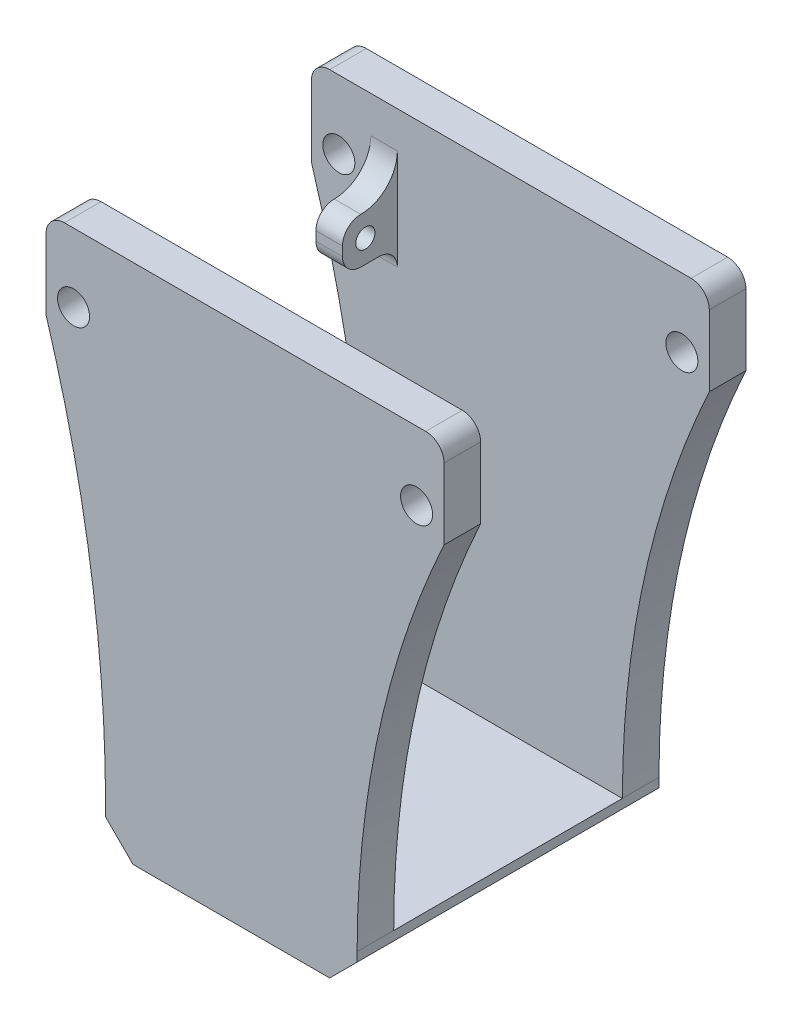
ISO-10303-21;
HEADER;
FILE_DESCRIPTION(('STEP AP214'),'2;1');
FILE_NAME('part.step','',(''),(''),'','','');
FILE_SCHEMA(('AUTOMOTIVE_DESIGN { 1 0 10303 214 1 1 1 1 }'));
ENDSEC;
DATA;
#1=APPLICATION_CONTEXT('core data for automotive mechanical design processes');
#2=APPLICATION_PROTOCOL_DEFINITION('international standard','automotive_design',2000,#1);
#3=PRODUCT_CONTEXT('',#1,'mechanical');
#4=PRODUCT('Part','Part','',(#3));
#5=PRODUCT_RELATED_PRODUCT_CATEGORY('part','',(#4));
#6=PRODUCT_DEFINITION_FORMATION('','',#4);
#7=PRODUCT_DEFINITION_CONTEXT('part definition',#1,'design');
#8=PRODUCT_DEFINITION('design','',#6,#7);
#9=PRODUCT_DEFINITION_SHAPE('','',#8);
#10=(LENGTH_UNIT() NAMED_UNIT(*) SI_UNIT(.MILLI.,.METRE.));
#11=(NAMED_UNIT(*) PLANE_ANGLE_UNIT() SI_UNIT($,.RADIAN.));
#12=(NAMED_UNIT(*) SI_UNIT($,.STERADIAN.) SOLID_ANGLE_UNIT());
#13=UNCERTAINTY_MEASURE_WITH_UNIT(LENGTH_MEASURE(1.E-05),#10,'distance_accuracy_value','');
#14=(GEOMETRIC_REPRESENTATION_CONTEXT(3) GLOBAL_UNCERTAINTY_ASSIGNED_CONTEXT((#13)) GLOBAL_UNIT_ASSIGNED_CONTEXT((#10,
#11,#12)) REPRESENTATION_CONTEXT('',''));
#15=CARTESIAN_POINT('',(0.,0.,0.));
#16=DIRECTION('',(0.,0.,1.));
#17=DIRECTION('',(1.,0.,0.));
#18=AXIS2_PLACEMENT_3D('',#15,#16,#17);
#19=CARTESIAN_POINT('',(0.,0.,0.));
#20=DIRECTION('',(0.,-1.,0.));
#21=DIRECTION('',(0.,0.,-1.));
#22=AXIS2_PLACEMENT_3D('',#19,#20,#21);
#23=PLANE('',#22);
#24=DIRECTION('',(-1.,0.,0.));
#25=VECTOR('',#24,1.);
#26=CARTESIAN_POINT('',(0.,0.,12.5));
#27=LINE('',#26,#25);
#28=CARTESIAN_POINT('',(12.25,0.,12.5));
#29=VERTEX_POINT('',#28);
#30=CARTESIAN_POINT('',(-12.35,0.,12.5));
#31=VERTEX_POINT('',#30);
#32=EDGE_CURVE('E615',#29,#31,#27,.T.);
#33=ORIENTED_EDGE('',*,*,#32,.F.);
#34=DIRECTION('',(0.,0.,-1.));
#35=VECTOR('',#34,1.);
#36=CARTESIAN_POINT('',(12.25,0.,16.5));
#37=LINE('',#36,#35);
#38=CARTESIAN_POINT('',(12.25,0.,-12.5));
#39=VERTEX_POINT('',#38);
#40=EDGE_CURVE('E927',#29,#39,#37,.T.);
#41=ORIENTED_EDGE('',*,*,#40,.T.);
#42=DIRECTION('',(-1.,0.,0.));
#43=VECTOR('',#42,1.);
#44=CARTESIAN_POINT('',(0.,0.,-12.5));
#45=LINE('',#44,#43);
#46=CARTESIAN_POINT('',(-12.35,0.,-12.5));
#47=VERTEX_POINT('',#46);
#48=EDGE_CURVE('E1012',#39,#47,#45,.T.);
#49=ORIENTED_EDGE('',*,*,#48,.T.);
#50=DIRECTION('',(0.,0.,1.));
#51=VECTOR('',#50,1.);
#52=CARTESIAN_POINT('',(-12.35,0.,-12.5));
#53=LINE('',#52,#51);
#54=CARTESIAN_POINT('',(-12.35,0.,-6.5));
#55=VERTEX_POINT('',#54);
#56=EDGE_CURVE('E513',#47,#55,#53,.T.);
#57=ORIENTED_EDGE('',*,*,#56,.T.);
#58=DIRECTION('',(-1.,0.,0.));
#59=VECTOR('',#58,1.);
#60=CARTESIAN_POINT('',(-12.35,0.,-6.5));
#61=LINE('',#60,#59);
#62=CARTESIAN_POINT('',(-15.25,0.,-6.5));
#63=VERTEX_POINT('',#62);
#64=EDGE_CURVE('E496',#55,#63,#61,.T.);
#65=ORIENTED_EDGE('',*,*,#64,.T.);
#66=DIRECTION('',(0.,0.,-1.));
#67=VECTOR('',#66,1.);
#68=CARTESIAN_POINT('',(-15.25,0.,16.5));
#69=LINE('',#68,#67);
#70=CARTESIAN_POINT('',(-15.25,0.,6.5));
#71=VERTEX_POINT('',#70);
#72=EDGE_CURVE('E379',#71,#63,#69,.T.);
#73=ORIENTED_EDGE('',*,*,#72,.F.);
#74=DIRECTION('',(-1.,0.,0.));
#75=VECTOR('',#74,1.);
#76=CARTESIAN_POINT('',(-12.35,0.,6.5));
#77=LINE('',#76,#75);
#78=CARTESIAN_POINT('',(-12.35,0.,6.5));
#79=VERTEX_POINT('',#78);
#80=EDGE_CURVE('E841',#79,#71,#77,.T.);
#81=ORIENTED_EDGE('',*,*,#80,.F.);
#82=DIRECTION('',(0.,0.,-1.));
#83=VECTOR('',#82,1.);
#84=CARTESIAN_POINT('',(-12.35,0.,12.5));
#85=LINE('',#84,#83);
#86=EDGE_CURVE('E827',#31,#79,#85,.T.);
#87=ORIENTED_EDGE('',*,*,#86,.F.);
#88=EDGE_LOOP('',(#33,#41,#49,#57,#65,#73,#81,#87));
#89=FACE_BOUND('',#88,.T.);
#90=ADVANCED_FACE('F51',(#89),#23,.F.);
#91=CARTESIAN_POINT('',(34.25,0.,-12.5));
#92=DIRECTION('',(0.,0.,-1.));
#93=DIRECTION('',(-1.,0.,0.));
#94=AXIS2_PLACEMENT_3D('',#91,#92,#93);
#95=PLANE('',#94);
#96=DIRECTION('',(-1.,0.,0.));
#97=VECTOR('',#96,1.);
#98=CARTESIAN_POINT('',(34.25,49.,-12.5));
#99=LINE('',#98,#97);
#100=CARTESIAN_POINT('',(-12.35,49.,-12.5));
#101=VERTEX_POINT('',#100);
#102=CARTESIAN_POINT('',(-15.25,49.,-12.5));
#103=VERTEX_POINT('',#102);
#104=EDGE_CURVE('E562',#101,#103,#99,.T.);
#105=ORIENTED_EDGE('',*,*,#104,.F.);
#106=DIRECTION('',(0.,-1.,0.));
#107=VECTOR('',#106,1.);
#108=CARTESIAN_POINT('',(-12.35,40.,-12.5));
#109=LINE('',#108,#107);
#110=CARTESIAN_POINT('',(-12.35,38.,-12.5));
#111=VERTEX_POINT('',#110);
#112=EDGE_CURVE('E539',#101,#111,#109,.T.);
#113=ORIENTED_EDGE('',*,*,#112,.T.);
#114=DIRECTION('',(-1.,0.,0.));
#115=VECTOR('',#114,1.);
#116=CARTESIAN_POINT('',(34.25,38.,-12.5));
#117=LINE('',#116,#115);
#118=CARTESIAN_POINT('',(-15.25,38.,-12.5));
#119=VERTEX_POINT('',#118);
#120=EDGE_CURVE('E1043',#111,#119,#117,.T.);
#121=ORIENTED_EDGE('',*,*,#120,.T.);
#122=DIRECTION('',(0.,-1.,0.));
#123=VECTOR('',#122,1.);
#124=CARTESIAN_POINT('',(-15.25,40.,-12.5));
#125=LINE('',#124,#123);
#126=EDGE_CURVE('E530',#103,#119,#125,.T.);
#127=ORIENTED_EDGE('',*,*,#126,.F.);
#128=EDGE_LOOP('',(#105,#113,#121,#127));
#129=FACE_BOUND('',#128,.T.);
#130=CARTESIAN_POINT('',(-18.75,45.5,-12.5));
#131=DIRECTION('',(0.,0.,-1.));
#132=DIRECTION('',(-1.,0.,0.));
#133=AXIS2_PLACEMENT_3D('',#130,#131,#132);
#134=CIRCLE('',#133,1.75);
#135=CARTESIAN_POINT('',(-20.5,45.5,-12.5));
#136=VERTEX_POINT('',#135);
#137=EDGE_CURVE('E490',#136,#136,#134,.F.);
#138=ORIENTED_EDGE('',*,*,#137,.F.);
#139=EDGE_LOOP('',(#138));
#140=FACE_BOUND('',#139,.T.);
#141=CARTESIAN_POINT('',(18.75,45.5,-12.5));
#142=DIRECTION('',(0.,0.,-1.));
#143=DIRECTION('',(-1.,0.,0.));
#144=AXIS2_PLACEMENT_3D('',#141,#142,#143);
#145=CIRCLE('',#144,1.75);
#146=CARTESIAN_POINT('',(17.,45.5,-12.5));
#147=VERTEX_POINT('',#146);
#148=EDGE_CURVE('E989',#147,#147,#145,.F.);
#149=ORIENTED_EDGE('',*,*,#148,.F.);
#150=EDGE_LOOP('',(#149));
#151=FACE_BOUND('',#150,.T.);
#152=ORIENTED_EDGE('',*,*,#48,.F.);
#153=CARTESIAN_POINT('',(115.450657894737,0.,-12.5));
#154=DIRECTION('',(0.,0.,-1.));
#155=DIRECTION('',(-1.,0.,0.));
#156=AXIS2_PLACEMENT_3D('',#153,#154,#155);
#157=CIRCLE('',#156,103.200657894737);
#158=CARTESIAN_POINT('',(21.75,43.25,-12.5));
#159=VERTEX_POINT('',#158);
#160=EDGE_CURVE('E911',#39,#159,#157,.T.);
#161=ORIENTED_EDGE('',*,*,#160,.T.);
#162=DIRECTION('',(0.,-1.,0.));
#163=VECTOR('',#162,1.);
#164=CARTESIAN_POINT('',(21.75,49.,-12.5));
#165=LINE('',#164,#163);
#166=CARTESIAN_POINT('',(21.75,51.,-12.5));
#167=VERTEX_POINT('',#166);
#168=EDGE_CURVE('E565',#167,#159,#165,.T.);
#169=ORIENTED_EDGE('',*,*,#168,.F.);
#170=CARTESIAN_POINT('',(19.75,51.,-12.5));
#171=DIRECTION('',(0.,0.,-1.));
#172=DIRECTION('',(-1.,0.,0.));
#173=AXIS2_PLACEMENT_3D('',#170,#171,#172);
#174=CIRCLE('',#173,2.);
#175=CARTESIAN_POINT('',(19.75,53.,-12.5));
#176=VERTEX_POINT('',#175);
#177=EDGE_CURVE('E1021',#167,#176,#174,.F.);
#178=ORIENTED_EDGE('',*,*,#177,.T.);
#179=DIRECTION('',(1.,0.,0.));
#180=VECTOR('',#179,1.);
#181=CARTESIAN_POINT('',(-15.25,53.,-12.5));
#182=LINE('',#181,#180);
#183=CARTESIAN_POINT('',(-19.75,53.,-12.5));
#184=VERTEX_POINT('',#183);
#185=EDGE_CURVE('E589',#184,#176,#182,.T.);
#186=ORIENTED_EDGE('',*,*,#185,.F.);
#187=CARTESIAN_POINT('',(-19.75,51.,-12.5));
#188=DIRECTION('',(0.,0.,-1.));
#189=DIRECTION('',(-1.,0.,0.));
#190=AXIS2_PLACEMENT_3D('',#187,#188,#189);
#191=CIRCLE('',#190,2.);
#192=CARTESIAN_POINT('',(-21.75,51.,-12.5));
#193=VERTEX_POINT('',#192);
#194=EDGE_CURVE('E67',#184,#193,#191,.F.);
#195=ORIENTED_EDGE('',*,*,#194,.T.);
#196=DIRECTION('',(0.,-1.,0.));
#197=VECTOR('',#196,1.);
#198=CARTESIAN_POINT('',(-21.75,0.,-12.5));
#199=LINE('',#198,#197);
#200=CARTESIAN_POINT('',(-21.75,43.25,-12.5));
#201=VERTEX_POINT('',#200);
#202=EDGE_CURVE('E557',#193,#201,#199,.T.);
#203=ORIENTED_EDGE('',*,*,#202,.T.);
#204=CARTESIAN_POINT('',(-162.389423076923,0.,-12.5));
#205=DIRECTION('',(0.,0.,-1.));
#206=DIRECTION('',(1.,0.,0.));
#207=AXIS2_PLACEMENT_3D('',#204,#205,#206);
#208=CIRCLE('',#207,147.139423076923);
#209=CARTESIAN_POINT('',(-15.4676417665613,8.,-12.5));
#210=VERTEX_POINT('',#209);
#211=EDGE_CURVE('E489',#201,#210,#208,.T.);
#212=ORIENTED_EDGE('',*,*,#211,.T.);
#213=DIRECTION('',(-1.,0.,0.));
#214=VECTOR('',#213,1.);
#215=CARTESIAN_POINT('',(34.25,8.,-12.5));
#216=LINE('',#215,#214);
#217=CARTESIAN_POINT('',(-12.35,8.,-12.5));
#218=VERTEX_POINT('',#217);
#219=EDGE_CURVE('E1039',#210,#218,#216,.F.);
#220=ORIENTED_EDGE('',*,*,#219,.T.);
#221=DIRECTION('',(0.,-1.,0.));
#222=VECTOR('',#221,1.);
#223=CARTESIAN_POINT('',(-12.35,0.,-12.5));
#224=LINE('',#223,#222);
#225=EDGE_CURVE('E517',#218,#47,#224,.T.);
#226=ORIENTED_EDGE('',*,*,#225,.T.);
#227=EDGE_LOOP('',(#152,#161,#169,#178,#186,#195,#203,#212,#220,#226));
#228=FACE_BOUND('',#227,.T.);
#229=ADVANCED_FACE('F441',(#129,#140,#151,#228),#95,.F.);
#230=CARTESIAN_POINT('',(21.75,49.,-16.5));
#231=DIRECTION('',(-1.,0.,0.));
#232=DIRECTION('',(0.,0.,1.));
#233=AXIS2_PLACEMENT_3D('',#230,#231,#232);
#234=PLANE('',#233);
#235=DIRECTION('',(0.,-1.,0.));
#236=VECTOR('',#235,1.);
#237=CARTESIAN_POINT('',(21.75,49.,-16.5));
#238=LINE('',#237,#236);
#239=CARTESIAN_POINT('',(21.75,51.,-16.5));
#240=VERTEX_POINT('',#239);
#241=CARTESIAN_POINT('',(21.75,43.25,-16.5));
#242=VERTEX_POINT('',#241);
#243=EDGE_CURVE('E1015',#240,#242,#238,.T.);
#244=ORIENTED_EDGE('',*,*,#243,.F.);
#245=DIRECTION('',(0.,0.,-1.));
#246=VECTOR('',#245,1.);
#247=CARTESIAN_POINT('',(21.75,51.,-12.5));
#248=LINE('',#247,#246);
#249=EDGE_CURVE('E75',#240,#167,#248,.F.);
#250=ORIENTED_EDGE('',*,*,#249,.T.);
#251=ORIENTED_EDGE('',*,*,#168,.T.);
#252=DIRECTION('',(0.,0.,-1.));
#253=VECTOR('',#252,1.);
#254=CARTESIAN_POINT('',(21.75,43.25,-16.5));
#255=LINE('',#254,#253);
#256=EDGE_CURVE('E543',#159,#242,#255,.T.);
#257=ORIENTED_EDGE('',*,*,#256,.T.);
#258=EDGE_LOOP('',(#244,#250,#251,#257));
#259=FACE_BOUND('',#258,.T.);
#260=ADVANCED_FACE('F446',(#259),#234,.F.);
#261=CARTESIAN_POINT('',(-21.75,49.,-16.5));
#262=DIRECTION('',(0.,0.,1.));
#263=DIRECTION('',(1.,0.,0.));
#264=AXIS2_PLACEMENT_3D('',#261,#262,#263);
#265=PLANE('',#264);
#266=CARTESIAN_POINT('',(-18.75,45.5,-16.5));
#267=DIRECTION('',(0.,0.,-1.));
#268=DIRECTION('',(-1.,0.,0.));
#269=AXIS2_PLACEMENT_3D('',#266,#267,#268);
#270=CIRCLE('',#269,1.75);
#271=CARTESIAN_POINT('',(-20.5,45.5,-16.5));
#272=VERTEX_POINT('',#271);
#273=EDGE_CURVE('E499',#272,#272,#270,.T.);
#274=ORIENTED_EDGE('',*,*,#273,.F.);
#275=EDGE_LOOP('',(#274));
#276=FACE_BOUND('',#275,.T.);
#277=CARTESIAN_POINT('',(18.75,45.5,-16.5));
#278=DIRECTION('',(0.,0.,-1.));
#279=DIRECTION('',(1.,0.,0.));
#280=AXIS2_PLACEMENT_3D('',#277,#278,#279);
#281=CIRCLE('',#280,1.75);
#282=CARTESIAN_POINT('',(20.5,45.5,-16.5));
#283=VERTEX_POINT('',#282);
#284=EDGE_CURVE('E1025',#283,#283,#281,.T.);
#285=ORIENTED_EDGE('',*,*,#284,.F.);
#286=EDGE_LOOP('',(#285));
#287=FACE_BOUND('',#286,.T.);
#288=ORIENTED_EDGE('',*,*,#243,.T.);
#289=CARTESIAN_POINT('',(115.450657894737,0.,-16.5));
#290=DIRECTION('',(0.,0.,-1.));
#291=DIRECTION('',(-1.,0.,0.));
#292=AXIS2_PLACEMENT_3D('',#289,#290,#291);
#293=CIRCLE('',#292,103.200657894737);
#294=CARTESIAN_POINT('',(12.25,0.,-16.5));
#295=VERTEX_POINT('',#294);
#296=EDGE_CURVE('E346',#295,#242,#293,.T.);
#297=ORIENTED_EDGE('',*,*,#296,.F.);
#298=DIRECTION('',(0.,1.,0.));
#299=VECTOR('',#298,1.);
#300=CARTESIAN_POINT('',(12.25,-1.,-16.5));
#301=LINE('',#300,#299);
#302=CARTESIAN_POINT('',(12.25,-1.,-16.5));
#303=VERTEX_POINT('',#302);
#304=EDGE_CURVE('E945',#303,#295,#301,.T.);
#305=ORIENTED_EDGE('',*,*,#304,.F.);
#306=DIRECTION('',(0.707106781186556,0.707106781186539,0.));
#307=VECTOR('',#306,1.);
#308=CARTESIAN_POINT('',(12.25,-1.,-16.5));
#309=LINE('',#308,#307);
#310=CARTESIAN_POINT('',(9.24999999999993,-4.,-16.5));
#311=VERTEX_POINT('',#310);
#312=EDGE_CURVE('E950',#311,#303,#309,.T.);
#313=ORIENTED_EDGE('',*,*,#312,.F.);
#314=DIRECTION('',(1.,0.,0.));
#315=VECTOR('',#314,1.);
#316=CARTESIAN_POINT('',(-15.25,-4.,-16.5));
#317=LINE('',#316,#315);
#318=CARTESIAN_POINT('',(-12.25,-4.,-16.5));
#319=VERTEX_POINT('',#318);
#320=EDGE_CURVE('E355',#319,#311,#317,.T.);
#321=ORIENTED_EDGE('',*,*,#320,.F.);
#322=DIRECTION('',(0.707106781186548,-0.707106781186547,0.));
#323=VECTOR('',#322,1.);
#324=CARTESIAN_POINT('',(-15.25,-1.,-16.5));
#325=LINE('',#324,#323);
#326=CARTESIAN_POINT('',(-15.25,-1.,-16.5));
#327=VERTEX_POINT('',#326);
#328=EDGE_CURVE('E480',#327,#319,#325,.T.);
#329=ORIENTED_EDGE('',*,*,#328,.F.);
#330=DIRECTION('',(0.,1.,0.));
#331=VECTOR('',#330,1.);
#332=CARTESIAN_POINT('',(-15.25,-4.,-16.5));
#333=LINE('',#332,#331);
#334=CARTESIAN_POINT('',(-15.25,0.,-16.5));
#335=VERTEX_POINT('',#334);
#336=EDGE_CURVE('E371',#327,#335,#333,.T.);
#337=ORIENTED_EDGE('',*,*,#336,.T.);
#338=CARTESIAN_POINT('',(-162.389423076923,0.,-16.5));
#339=DIRECTION('',(0.,0.,-1.));
#340=DIRECTION('',(1.,0.,0.));
#341=AXIS2_PLACEMENT_3D('',#338,#339,#340);
#342=CIRCLE('',#341,147.139423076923);
#343=CARTESIAN_POINT('',(-21.75,43.25,-16.5));
#344=VERTEX_POINT('',#343);
#345=EDGE_CURVE('E479',#344,#335,#342,.T.);
#346=ORIENTED_EDGE('',*,*,#345,.F.);
#347=DIRECTION('',(0.,-1.,0.));
#348=VECTOR('',#347,1.);
#349=CARTESIAN_POINT('',(-21.75,49.,-16.5));
#350=LINE('',#349,#348);
#351=CARTESIAN_POINT('',(-21.75,51.,-16.5));
#352=VERTEX_POINT('',#351);
#353=EDGE_CURVE('E1017',#352,#344,#350,.T.);
#354=ORIENTED_EDGE('',*,*,#353,.F.);
#355=CARTESIAN_POINT('',(-19.75,51.,-16.5));
#356=DIRECTION('',(0.,0.,1.));
#357=DIRECTION('',(1.,0.,0.));
#358=AXIS2_PLACEMENT_3D('',#355,#356,#357);
#359=CIRCLE('',#358,2.);
#360=CARTESIAN_POINT('',(-19.75,53.,-16.5));
#361=VERTEX_POINT('',#360);
#362=EDGE_CURVE('E1197',#352,#361,#359,.F.);
#363=ORIENTED_EDGE('',*,*,#362,.T.);
#364=DIRECTION('',(-1.,0.,0.));
#365=VECTOR('',#364,1.);
#366=CARTESIAN_POINT('',(21.75,53.,-16.5));
#367=LINE('',#366,#365);
#368=CARTESIAN_POINT('',(19.75,53.,-16.5));
#369=VERTEX_POINT('',#368);
#370=EDGE_CURVE('E685',#369,#361,#367,.T.);
#371=ORIENTED_EDGE('',*,*,#370,.F.);
#372=CARTESIAN_POINT('',(19.75,51.,-16.5));
#373=DIRECTION('',(0.,0.,1.));
#374=DIRECTION('',(1.,0.,0.));
#375=AXIS2_PLACEMENT_3D('',#372,#373,#374);
#376=CIRCLE('',#375,2.);
#377=EDGE_CURVE('E961',#369,#240,#376,.F.);
#378=ORIENTED_EDGE('',*,*,#377,.T.);
#379=EDGE_LOOP('',(#288,#297,#305,#313,#321,#329,#337,#346,#354,#363,#371,#378));
#380=FACE_BOUND('',#379,.T.);
#381=ADVANCED_FACE('F477',(#276,#287,#380),#265,.F.);
#382=CARTESIAN_POINT('',(-21.75,49.,-16.5));
#383=DIRECTION('',(1.,0.,0.));
#384=DIRECTION('',(0.,0.,-1.));
#385=AXIS2_PLACEMENT_3D('',#382,#383,#384);
#386=PLANE('',#385);
#387=ORIENTED_EDGE('',*,*,#202,.F.);
#388=DIRECTION('',(0.,0.,1.));
#389=VECTOR('',#388,1.);
#390=CARTESIAN_POINT('',(-21.75,51.,-16.5));
#391=LINE('',#390,#389);
#392=EDGE_CURVE('E60',#193,#352,#391,.F.);
#393=ORIENTED_EDGE('',*,*,#392,.T.);
#394=ORIENTED_EDGE('',*,*,#353,.T.);
#395=DIRECTION('',(0.,0.,-1.));
#396=VECTOR('',#395,1.);
#397=CARTESIAN_POINT('',(-21.75,43.25,-16.5));
#398=LINE('',#397,#396);
#399=EDGE_CURVE('E487',#201,#344,#398,.T.);
#400=ORIENTED_EDGE('',*,*,#399,.F.);
#401=EDGE_LOOP('',(#387,#393,#394,#400));
#402=FACE_BOUND('',#401,.T.);
#403=ADVANCED_FACE('F1142',(#402),#386,.F.);
#404=CARTESIAN_POINT('',(-15.25,0.,0.));
#405=DIRECTION('',(-1.,0.,0.));
#406=DIRECTION('',(0.,0.,1.));
#407=AXIS2_PLACEMENT_3D('',#404,#405,#406);
#408=PLANE('',#407);
#409=DIRECTION('',(0.,0.,1.));
#410=VECTOR('',#409,1.);
#411=CARTESIAN_POINT('',(-15.25,40.,-6.5));
#412=LINE('',#411,#410);
#413=CARTESIAN_POINT('',(-15.25,40.,-10.5));
#414=VERTEX_POINT('',#413);
#415=CARTESIAN_POINT('',(-15.25,40.,-8.5));
#416=VERTEX_POINT('',#415);
#417=EDGE_CURVE('E544',#414,#416,#412,.T.);
#418=ORIENTED_EDGE('',*,*,#417,.T.);
#419=CARTESIAN_POINT('',(-15.25,42.,-8.5));
#420=DIRECTION('',(-1.,0.,0.));
#421=DIRECTION('',(0.,0.,1.));
#422=AXIS2_PLACEMENT_3D('',#419,#420,#421);
#423=CIRCLE('',#422,2.);
#424=CARTESIAN_POINT('',(-15.25,42.,-6.5));
#425=VERTEX_POINT('',#424);
#426=EDGE_CURVE('E1096',#416,#425,#423,.T.);
#427=ORIENTED_EDGE('',*,*,#426,.T.);
#428=DIRECTION('',(0.,1.,0.));
#429=VECTOR('',#428,1.);
#430=CARTESIAN_POINT('',(-15.25,45.,-6.5));
#431=LINE('',#430,#429);
#432=CARTESIAN_POINT('',(-15.25,43.,-6.5));
#433=VERTEX_POINT('',#432);
#434=EDGE_CURVE('E548',#425,#433,#431,.T.);
#435=ORIENTED_EDGE('',*,*,#434,.T.);
#436=CARTESIAN_POINT('',(-15.25,43.,-8.5));
#437=DIRECTION('',(-1.,0.,0.));
#438=DIRECTION('',(0.,0.,1.));
#439=AXIS2_PLACEMENT_3D('',#436,#437,#438);
#440=CIRCLE('',#439,2.);
#441=CARTESIAN_POINT('',(-15.25,45.,-8.5));
#442=VERTEX_POINT('',#441);
#443=EDGE_CURVE('E1099',#433,#442,#440,.T.);
#444=ORIENTED_EDGE('',*,*,#443,.T.);
#445=CARTESIAN_POINT('',(-15.25,49.,-8.5));
#446=DIRECTION('',(-1.,0.,0.));
#447=DIRECTION('',(0.,0.,1.));
#448=AXIS2_PLACEMENT_3D('',#445,#446,#447);
#449=CIRCLE('',#448,4.);
#450=EDGE_CURVE('E582',#442,#103,#449,.F.);
#451=ORIENTED_EDGE('',*,*,#450,.T.);
#452=ORIENTED_EDGE('',*,*,#126,.T.);
#453=CARTESIAN_POINT('',(-15.25,38.,-10.5));
#454=DIRECTION('',(-1.,0.,0.));
#455=DIRECTION('',(0.,0.,1.));
#456=AXIS2_PLACEMENT_3D('',#453,#454,#455);
#457=CIRCLE('',#456,2.);
#458=EDGE_CURVE('E1072',#119,#414,#457,.F.);
#459=ORIENTED_EDGE('',*,*,#458,.T.);
#460=EDGE_LOOP('',(#418,#427,#435,#444,#451,#452,#459));
#461=FACE_BOUND('',#460,.T.);
#462=CARTESIAN_POINT('',(-15.25,42.5,-9.));
#463=DIRECTION('',(-1.,0.,0.));
#464=DIRECTION('',(0.,0.,1.));
#465=AXIS2_PLACEMENT_3D('',#462,#463,#464);
#466=CIRCLE('',#465,1.05);
#467=CARTESIAN_POINT('',(-15.25,42.5,-7.95));
#468=VERTEX_POINT('',#467);
#469=EDGE_CURVE('E525',#468,#468,#466,.T.);
#470=ORIENTED_EDGE('',*,*,#469,.F.);
#471=EDGE_LOOP('',(#470));
#472=FACE_BOUND('',#471,.T.);
#473=ADVANCED_FACE('F1139',(#461,#472),#408,.T.);
#474=CARTESIAN_POINT('',(-12.35,45.,-6.5));
#475=DIRECTION('',(0.,0.,1.));
#476=DIRECTION('',(1.,0.,0.));
#477=AXIS2_PLACEMENT_3D('',#474,#475,#476);
#478=PLANE('',#477);
#479=ORIENTED_EDGE('',*,*,#434,.F.);
#480=DIRECTION('',(-1.,0.,0.));
#481=VECTOR('',#480,1.);
#482=CARTESIAN_POINT('',(-12.35,42.,-6.5));
#483=LINE('',#482,#481);
#484=CARTESIAN_POINT('',(-12.35,42.,-6.5));
#485=VERTEX_POINT('',#484);
#486=EDGE_CURVE('E1089',#425,#485,#483,.F.);
#487=ORIENTED_EDGE('',*,*,#486,.T.);
#488=DIRECTION('',(0.,1.,0.));
#489=VECTOR('',#488,1.);
#490=CARTESIAN_POINT('',(-12.35,45.,-6.5));
#491=LINE('',#490,#489);
#492=CARTESIAN_POINT('',(-12.35,43.,-6.5));
#493=VERTEX_POINT('',#492);
#494=EDGE_CURVE('E538',#485,#493,#491,.T.);
#495=ORIENTED_EDGE('',*,*,#494,.T.);
#496=DIRECTION('',(-1.,0.,0.));
#497=VECTOR('',#496,1.);
#498=CARTESIAN_POINT('',(-12.35,43.,-6.5));
#499=LINE('',#498,#497);
#500=EDGE_CURVE('E1092',#493,#433,#499,.T.);
#501=ORIENTED_EDGE('',*,*,#500,.T.);
#502=EDGE_LOOP('',(#479,#487,#495,#501));
#503=FACE_BOUND('',#502,.T.);
#504=ADVANCED_FACE('F1135',(#503),#478,.T.);
#505=CARTESIAN_POINT('',(-12.35,40.,-6.5));
#506=DIRECTION('',(0.,-1.,0.));
#507=DIRECTION('',(0.,0.,-1.));
#508=AXIS2_PLACEMENT_3D('',#505,#506,#507);
#509=PLANE('',#508);
#510=DIRECTION('',(0.,0.,1.));
#511=VECTOR('',#510,1.);
#512=CARTESIAN_POINT('',(-12.35,40.,-6.5));
#513=LINE('',#512,#511);
#514=CARTESIAN_POINT('',(-12.35,40.,-10.5));
#515=VERTEX_POINT('',#514);
#516=CARTESIAN_POINT('',(-12.35,40.,-8.5));
#517=VERTEX_POINT('',#516);
#518=EDGE_CURVE('E534',#515,#517,#513,.T.);
#519=ORIENTED_EDGE('',*,*,#518,.T.);
#520=DIRECTION('',(-1.,0.,0.));
#521=VECTOR('',#520,1.);
#522=CARTESIAN_POINT('',(-12.35,40.,-8.5));
#523=LINE('',#522,#521);
#524=EDGE_CURVE('E1103',#517,#416,#523,.T.);
#525=ORIENTED_EDGE('',*,*,#524,.T.);
#526=ORIENTED_EDGE('',*,*,#417,.F.);
#527=DIRECTION('',(-1.,0.,0.));
#528=VECTOR('',#527,1.);
#529=CARTESIAN_POINT('',(-12.35,40.,-10.5));
#530=LINE('',#529,#528);
#531=EDGE_CURVE('E1107',#414,#515,#530,.F.);
#532=ORIENTED_EDGE('',*,*,#531,.T.);
#533=EDGE_LOOP('',(#519,#525,#526,#532));
#534=FACE_BOUND('',#533,.T.);
#535=ADVANCED_FACE('F1114',(#534),#509,.T.);
#536=CARTESIAN_POINT('',(-12.35,0.,0.));
#537=DIRECTION('',(1.,0.,0.));
#538=DIRECTION('',(0.,0.,-1.));
#539=AXIS2_PLACEMENT_3D('',#536,#537,#538);
#540=PLANE('',#539);
#541=CARTESIAN_POINT('',(-12.35,42.5,-9.));
#542=DIRECTION('',(-1.,0.,0.));
#543=DIRECTION('',(0.,0.,1.));
#544=AXIS2_PLACEMENT_3D('',#541,#542,#543);
#545=CIRCLE('',#544,1.05);
#546=CARTESIAN_POINT('',(-12.35,42.5,-7.95));
#547=VERTEX_POINT('',#546);
#548=EDGE_CURVE('E526',#547,#547,#545,.T.);
#549=ORIENTED_EDGE('',*,*,#548,.T.);
#550=EDGE_LOOP('',(#549));
#551=FACE_BOUND('',#550,.T.);
#552=ORIENTED_EDGE('',*,*,#494,.F.);
#553=CARTESIAN_POINT('',(-12.35,42.,-8.5));
#554=DIRECTION('',(1.,0.,0.));
#555=DIRECTION('',(0.,0.,-1.));
#556=AXIS2_PLACEMENT_3D('',#553,#554,#555);
#557=CIRCLE('',#556,2.);
#558=EDGE_CURVE('E1083',#485,#517,#557,.T.);
#559=ORIENTED_EDGE('',*,*,#558,.T.);
#560=ORIENTED_EDGE('',*,*,#518,.F.);
#561=CARTESIAN_POINT('',(-12.35,38.,-10.5));
#562=DIRECTION('',(1.,0.,0.));
#563=DIRECTION('',(0.,0.,-1.));
#564=AXIS2_PLACEMENT_3D('',#561,#562,#563);
#565=CIRCLE('',#564,2.);
#566=EDGE_CURVE('E1067',#515,#111,#565,.F.);
#567=ORIENTED_EDGE('',*,*,#566,.T.);
#568=ORIENTED_EDGE('',*,*,#112,.F.);
#569=CARTESIAN_POINT('',(-12.35,49.,-8.5));
#570=DIRECTION('',(1.,0.,0.));
#571=DIRECTION('',(0.,0.,-1.));
#572=AXIS2_PLACEMENT_3D('',#569,#570,#571);
#573=CIRCLE('',#572,4.);
#574=CARTESIAN_POINT('',(-12.35,45.,-8.5));
#575=VERTEX_POINT('',#574);
#576=EDGE_CURVE('E578',#101,#575,#573,.F.);
#577=ORIENTED_EDGE('',*,*,#576,.T.);
#578=CARTESIAN_POINT('',(-12.35,43.,-8.5));
#579=DIRECTION('',(1.,0.,0.));
#580=DIRECTION('',(0.,0.,-1.));
#581=AXIS2_PLACEMENT_3D('',#578,#579,#580);
#582=CIRCLE('',#581,2.);
#583=EDGE_CURVE('E1086',#575,#493,#582,.T.);
#584=ORIENTED_EDGE('',*,*,#583,.T.);
#585=EDGE_LOOP('',(#552,#559,#560,#567,#568,#577,#584));
#586=FACE_BOUND('',#585,.T.);
#587=ADVANCED_FACE('F1121',(#551,#586),#540,.T.);
#588=CARTESIAN_POINT('',(-12.35,42.5,-9.));
#589=DIRECTION('',(-1.,0.,0.));
#590=DIRECTION('',(0.,0.,1.));
#591=AXIS2_PLACEMENT_3D('',#588,#589,#590);
#592=CYLINDRICAL_SURFACE('',#591,1.05);
#593=ORIENTED_EDGE('',*,*,#548,.F.);
#594=EDGE_LOOP('',(#593));
#595=FACE_BOUND('',#594,.T.);
#596=ORIENTED_EDGE('',*,*,#469,.T.);
#597=EDGE_LOOP('',(#596));
#598=FACE_BOUND('',#597,.T.);
#599=ADVANCED_FACE('F1146',(#595,#598),#592,.F.);
#600=CARTESIAN_POINT('',(-12.35,6.,-12.5));
#601=DIRECTION('',(0.,1.,0.));
#602=DIRECTION('',(0.,0.,1.));
#603=AXIS2_PLACEMENT_3D('',#600,#601,#602);
#604=PLANE('',#603);
#605=DIRECTION('',(-1.,0.,0.));
#606=VECTOR('',#605,1.);
#607=CARTESIAN_POINT('',(-12.35,6.,-10.5));
#608=LINE('',#607,#606);
#609=CARTESIAN_POINT('',(-12.35,6.,-10.5));
#610=VERTEX_POINT('',#609);
#611=CARTESIAN_POINT('',(-15.3723838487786,6.,-10.5));
#612=VERTEX_POINT('',#611);
#613=EDGE_CURVE('E1002',#610,#612,#608,.T.);
#614=ORIENTED_EDGE('',*,*,#613,.T.);
#615=DIRECTION('',(0.,0.,-1.));
#616=VECTOR('',#615,1.);
#617=CARTESIAN_POINT('',(-15.3723838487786,6.,-12.5));
#618=LINE('',#617,#616);
#619=CARTESIAN_POINT('',(-15.3723838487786,6.,-8.5));
#620=VERTEX_POINT('',#619);
#621=EDGE_CURVE('E393',#612,#620,#618,.F.);
#622=ORIENTED_EDGE('',*,*,#621,.T.);
#623=DIRECTION('',(-1.,0.,0.));
#624=VECTOR('',#623,1.);
#625=CARTESIAN_POINT('',(-12.35,6.,-8.5));
#626=LINE('',#625,#624);
#627=CARTESIAN_POINT('',(-12.35,6.,-8.5));
#628=VERTEX_POINT('',#627);
#629=EDGE_CURVE('E999',#620,#628,#626,.F.);
#630=ORIENTED_EDGE('',*,*,#629,.T.);
#631=DIRECTION('',(0.,0.,-1.));
#632=VECTOR('',#631,1.);
#633=CARTESIAN_POINT('',(-12.35,6.,-12.5));
#634=LINE('',#633,#632);
#635=EDGE_CURVE('E505',#628,#610,#634,.T.);
#636=ORIENTED_EDGE('',*,*,#635,.T.);
#637=EDGE_LOOP('',(#614,#622,#630,#636));
#638=FACE_BOUND('',#637,.T.);
#639=ADVANCED_FACE('F1058',(#638),#604,.T.);
#640=CARTESIAN_POINT('',(-12.35,6.,-6.5));
#641=DIRECTION('',(0.,0.,1.));
#642=DIRECTION('',(1.,0.,0.));
#643=AXIS2_PLACEMENT_3D('',#640,#641,#642);
#644=PLANE('',#643);
#645=DIRECTION('',(0.,1.,0.));
#646=VECTOR('',#645,1.);
#647=CARTESIAN_POINT('',(-12.35,6.,-6.5));
#648=LINE('',#647,#646);
#649=CARTESIAN_POINT('',(-12.35,4.,-6.5));
#650=VERTEX_POINT('',#649);
#651=EDGE_CURVE('E509',#55,#650,#648,.T.);
#652=ORIENTED_EDGE('',*,*,#651,.T.);
#653=DIRECTION('',(-1.,0.,0.));
#654=VECTOR('',#653,1.);
#655=CARTESIAN_POINT('',(-12.35,4.,-6.5));
#656=LINE('',#655,#654);
#657=CARTESIAN_POINT('',(-15.3043802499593,4.,-6.5));
#658=VERTEX_POINT('',#657);
#659=EDGE_CURVE('E1008',#650,#658,#656,.T.);
#660=ORIENTED_EDGE('',*,*,#659,.T.);
#661=CARTESIAN_POINT('',(-162.389423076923,0.,-6.5));
#662=DIRECTION('',(0.,0.,-1.));
#663=DIRECTION('',(-1.,0.,0.));
#664=AXIS2_PLACEMENT_3D('',#661,#662,#663);
#665=CIRCLE('',#664,147.139423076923);
#666=EDGE_CURVE('E425',#658,#63,#665,.T.);
#667=ORIENTED_EDGE('',*,*,#666,.T.);
#668=ORIENTED_EDGE('',*,*,#64,.F.);
#669=EDGE_LOOP('',(#652,#660,#667,#668));
#670=FACE_BOUND('',#669,.T.);
#671=ADVANCED_FACE('F407',(#670),#644,.T.);
#672=CARTESIAN_POINT('',(-12.35,0.,0.));
#673=DIRECTION('',(1.,0.,0.));
#674=DIRECTION('',(0.,0.,-1.));
#675=AXIS2_PLACEMENT_3D('',#672,#673,#674);
#676=PLANE('',#675);
#677=CARTESIAN_POINT('',(-12.35,3.5,-9.));
#678=DIRECTION('',(-1.,0.,0.));
#679=DIRECTION('',(0.,0.,1.));
#680=AXIS2_PLACEMENT_3D('',#677,#678,#679);
#681=CIRCLE('',#680,1.05);
#682=CARTESIAN_POINT('',(-12.35,3.5,-7.95));
#683=VERTEX_POINT('',#682);
#684=EDGE_CURVE('E521',#683,#683,#681,.T.);
#685=ORIENTED_EDGE('',*,*,#684,.T.);
#686=EDGE_LOOP('',(#685));
#687=FACE_BOUND('',#686,.T.);
#688=ORIENTED_EDGE('',*,*,#635,.F.);
#689=CARTESIAN_POINT('',(-12.35,4.,-8.5));
#690=DIRECTION('',(1.,0.,0.));
#691=DIRECTION('',(0.,0.,-1.));
#692=AXIS2_PLACEMENT_3D('',#689,#690,#691);
#693=CIRCLE('',#692,2.);
#694=EDGE_CURVE('E1001',#628,#650,#693,.T.);
#695=ORIENTED_EDGE('',*,*,#694,.T.);
#696=ORIENTED_EDGE('',*,*,#651,.F.);
#697=ORIENTED_EDGE('',*,*,#56,.F.);
#698=ORIENTED_EDGE('',*,*,#225,.F.);
#699=CARTESIAN_POINT('',(-12.35,8.,-10.5));
#700=DIRECTION('',(1.,0.,0.));
#701=DIRECTION('',(0.,0.,-1.));
#702=AXIS2_PLACEMENT_3D('',#699,#700,#701);
#703=CIRCLE('',#702,2.);
#704=EDGE_CURVE('E1063',#218,#610,#703,.F.);
#705=ORIENTED_EDGE('',*,*,#704,.T.);
#706=EDGE_LOOP('',(#688,#695,#696,#697,#698,#705));
#707=FACE_BOUND('',#706,.T.);
#708=ADVANCED_FACE('F1061',(#687,#707),#676,.T.);
#709=CARTESIAN_POINT('',(-12.35,3.5,-9.));
#710=DIRECTION('',(-1.,0.,0.));
#711=DIRECTION('',(0.,0.,1.));
#712=AXIS2_PLACEMENT_3D('',#709,#710,#711);
#713=CYLINDRICAL_SURFACE('',#712,1.05);
#714=ORIENTED_EDGE('',*,*,#684,.F.);
#715=EDGE_LOOP('',(#714));
#716=FACE_BOUND('',#715,.T.);
#717=CARTESIAN_POINT('',(-15.2916330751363,3.5,-10.05));
#718=CARTESIAN_POINT('',(-15.2930368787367,3.55899684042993,-10.049997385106));
#719=CARTESIAN_POINT('',(-15.2944774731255,3.61803561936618,-10.0450110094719));
#720=CARTESIAN_POINT('',(-15.2973877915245,3.73448564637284,-10.0251891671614));
#721=CARTESIAN_POINT('',(-15.2988575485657,3.79189484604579,-10.0103418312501));
#722=CARTESIAN_POINT('',(-15.3017739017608,3.90338211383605,-9.97122067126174));
#723=CARTESIAN_POINT('',(-15.303220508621,3.9574617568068,-9.94695134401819));
#724=CARTESIAN_POINT('',(-15.3060362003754,4.06076370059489,-9.88968060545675));
#725=CARTESIAN_POINT('',(-15.3074053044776,4.10998720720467,-9.85668136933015));
#726=CARTESIAN_POINT('',(-15.3100109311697,4.20219915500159,-9.78288166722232));
#727=CARTESIAN_POINT('',(-15.3112474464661,4.24518725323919,-9.74208077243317));
#728=CARTESIAN_POINT('',(-15.3135346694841,4.32370436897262,-9.65383436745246));
#729=CARTESIAN_POINT('',(-15.31458537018,4.35923310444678,-9.60638860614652));
#730=CARTESIAN_POINT('',(-15.3164533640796,4.42180805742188,-9.50621751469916));
#731=CARTESIAN_POINT('',(-15.317270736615,4.44885715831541,-9.45349398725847));
#732=CARTESIAN_POINT('',(-15.3186346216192,4.49371930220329,-9.34425076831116));
#733=CARTESIAN_POINT('',(-15.3191811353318,4.51153238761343,-9.28773109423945));
#734=CARTESIAN_POINT('',(-15.3199772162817,4.53740971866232,-9.17252562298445));
#735=CARTESIAN_POINT('',(-15.3202269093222,4.54547809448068,-9.11384075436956));
#736=CARTESIAN_POINT('',(-15.320417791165,4.55164999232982,-8.99594898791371));
#737=CARTESIAN_POINT('',(-15.3203589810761,4.54975355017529,-8.93674209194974));
#738=CARTESIAN_POINT('',(-15.3199357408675,4.53605159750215,-8.81950211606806));
#739=CARTESIAN_POINT('',(-15.3195713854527,4.52424850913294,-8.7614687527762));
#740=CARTESIAN_POINT('',(-15.3185545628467,4.49107237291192,-8.64820782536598));
#741=CARTESIAN_POINT('',(-15.3179020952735,4.4696993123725,-8.59298026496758));
#742=CARTESIAN_POINT('',(-15.316339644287,4.4179881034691,-8.48689136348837));
#743=CARTESIAN_POINT('',(-15.3154296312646,4.38764892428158,-8.43603052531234));
#744=CARTESIAN_POINT('',(-15.3133938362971,4.31886859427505,-8.34012391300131));
#745=CARTESIAN_POINT('',(-15.3122680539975,4.28042743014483,-8.29507814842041));
#746=CARTESIAN_POINT('',(-15.3098499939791,4.1965179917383,-8.21206143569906));
#747=CARTESIAN_POINT('',(-15.3085576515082,4.15104698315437,-8.17409325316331));
#748=CARTESIAN_POINT('',(-15.3058612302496,4.05437935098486,-8.10632907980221));
#749=CARTESIAN_POINT('',(-15.3044571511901,4.00318271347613,-8.07653310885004));
#750=CARTESIAN_POINT('',(-15.3015921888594,3.8964950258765,-8.02594746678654));
#751=CARTESIAN_POINT('',(-15.3001312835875,3.8410023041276,-8.0051613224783));
#752=CARTESIAN_POINT('',(-15.2972064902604,3.7273146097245,-7.9732017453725));
#753=CARTESIAN_POINT('',(-15.2957426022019,3.66911963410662,-7.96202832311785));
#754=CARTESIAN_POINT('',(-15.2928598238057,3.55166903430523,-7.94961050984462));
#755=CARTESIAN_POINT('',(-15.2914409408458,3.49241323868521,-7.94836773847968));
#756=CARTESIAN_POINT('',(-15.2886894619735,3.3745325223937,-7.95585160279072));
#757=CARTESIAN_POINT('',(-15.2873568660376,3.31590760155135,-7.96457823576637));
#758=CARTESIAN_POINT('',(-15.2848106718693,3.20095908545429,-7.99175295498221));
#759=CARTESIAN_POINT('',(-15.2835970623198,3.14463527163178,-8.01020011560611));
#760=CARTESIAN_POINT('',(-15.2813124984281,3.03588315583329,-8.05629272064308));
#761=CARTESIAN_POINT('',(-15.2802415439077,2.98345484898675,-8.08393815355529));
#762=CARTESIAN_POINT('',(-15.2782580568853,2.88399500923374,-8.14763594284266));
#763=CARTESIAN_POINT('',(-15.2773454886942,2.83696226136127,-8.18368640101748));
#764=CARTESIAN_POINT('',(-15.2756869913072,2.74961644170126,-8.26317476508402));
#765=CARTESIAN_POINT('',(-15.2749410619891,2.70930336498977,-8.30661266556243));
#766=CARTESIAN_POINT('',(-15.2736191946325,2.63655058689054,-8.39963277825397));
#767=CARTESIAN_POINT('',(-15.2730432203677,2.60410920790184,-8.44921367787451));
#768=CARTESIAN_POINT('',(-15.2720608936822,2.54801063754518,-8.55311957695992));
#769=CARTESIAN_POINT('',(-15.2716545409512,2.52435343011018,-8.6074445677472));
#770=CARTESIAN_POINT('',(-15.2710098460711,2.48649808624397,-8.71928853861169));
#771=CARTESIAN_POINT('',(-15.2707714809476,2.47229865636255,-8.77680708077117));
#772=CARTESIAN_POINT('',(-15.2704610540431,2.45375712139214,-8.89341213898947));
#773=CARTESIAN_POINT('',(-15.270388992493,2.44941502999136,-8.95249865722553));
#774=CARTESIAN_POINT('',(-15.2704105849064,2.45071155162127,-9.07055837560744));
#775=CARTESIAN_POINT('',(-15.2705042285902,2.45634954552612,-9.12953158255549));
#776=CARTESIAN_POINT('',(-15.2708579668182,2.47744488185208,-9.24569439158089));
#777=CARTESIAN_POINT('',(-15.2711180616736,2.49290224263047,-9.30288399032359));
#778=CARTESIAN_POINT('',(-15.27180639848,2.53319750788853,-9.41385711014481));
#779=CARTESIAN_POINT('',(-15.2722346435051,2.55803558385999,-9.46764056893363));
#780=CARTESIAN_POINT('',(-15.2732608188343,2.61638559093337,-9.57027173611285));
#781=CARTESIAN_POINT('',(-15.2738587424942,2.6498971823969,-9.61911963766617));
#782=CARTESIAN_POINT('',(-15.2752240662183,2.72464051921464,-9.71049395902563));
#783=CARTESIAN_POINT('',(-15.2759914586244,2.76587191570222,-9.75302066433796));
#784=CARTESIAN_POINT('',(-15.2776922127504,2.85489812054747,-9.83055904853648));
#785=CARTESIAN_POINT('',(-15.2786256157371,2.9026945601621,-9.86556885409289));
#786=CARTESIAN_POINT('',(-15.280649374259,3.00350877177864,-9.92708528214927));
#787=CARTESIAN_POINT('',(-15.2817398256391,3.0565297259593,-9.95358667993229));
#788=CARTESIAN_POINT('',(-15.2840599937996,3.16622370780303,-9.997281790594));
#789=CARTESIAN_POINT('',(-15.2852895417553,3.22289227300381,-10.0144866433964));
#790=CARTESIAN_POINT('',(-15.2873792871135,3.31660126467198,-10.0345176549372));
#791=CARTESIAN_POINT('',(-15.2882051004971,3.35303383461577,-10.0403163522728));
#792=CARTESIAN_POINT('',(-15.2898935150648,3.42630548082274,-10.0480583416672));
#793=CARTESIAN_POINT('',(-15.2907561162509,3.46314455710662,-10.0500016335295));
#794=CARTESIAN_POINT('',(-15.2916330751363,3.5,-10.05));
#795=B_SPLINE_CURVE_WITH_KNOTS('',3,(#717,#718,#719,#720,#721,#722,#723,#724,#725,#726,#727,
#728,#729,#730,#731,#732,#733,#734,#735,#736,#737,#738,#739,#740,#741,#742,#743,#744,#745,#746,
#747,#748,#749,#750,#751,#752,#753,#754,#755,#756,#757,#758,#759,#760,#761,#762,#763,#764,#765,
#766,#767,#768,#769,#770,#771,#772,#773,#774,#775,#776,#777,#778,#779,#780,#781,#782,#783,#784,
#785,#786,#787,#788,#789,#790,#791,#792,#793,#794),.UNSPECIFIED.,.T.,.F.,(4,2,2,2,2,2,2,2,2,2,2,
2,2,2,2,2,2,2,2,2,2,2,2,2,2,2,2,2,2,2,2,2,2,2,2,2,2,2,4),(0.,0.176906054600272,0.35402543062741,
0.531060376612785,0.708051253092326,0.885051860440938,1.06205915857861,1.23900620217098,
1.41595243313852,1.59282364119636,1.76969421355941,1.9465215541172,2.12334912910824,
2.30019704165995,2.4770452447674,2.65396240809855,2.83088000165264,3.00786678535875,
3.18485376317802,3.36186960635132,3.53888540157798,3.7158843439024,3.89288306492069,
4.06984185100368,4.24680050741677,4.42372141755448,4.60064200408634,4.77753838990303,
4.95443502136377,5.13132067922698,5.30820666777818,5.48509589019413,5.66197818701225,
5.83885249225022,6.01577082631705,6.19279759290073,6.36961175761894,6.48012531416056,
6.5906388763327),.UNSPECIFIED.);
#796=CARTESIAN_POINT('',(-15.2916330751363,3.5,-10.05));
#797=VERTEX_POINT('',#796);
#798=EDGE_CURVE('E412',#797,#797,#795,.T.);
#799=ORIENTED_EDGE('',*,*,#798,.F.);
#800=EDGE_LOOP('',(#799));
#801=FACE_BOUND('',#800,.T.);
#802=ADVANCED_FACE('F404',(#716,#801),#713,.F.);
#803=CARTESIAN_POINT('',(-162.389423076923,0.,-12.5));
#804=DIRECTION('',(0.,0.,-1.));
#805=DIRECTION('',(-1.,0.,0.));
#806=AXIS2_PLACEMENT_3D('',#803,#804,#805);
#807=CYLINDRICAL_SURFACE('',#806,147.139423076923);
#808=ORIENTED_EDGE('',*,*,#345,.T.);
#809=DIRECTION('',(0.,0.,1.));
#810=VECTOR('',#809,1.);
#811=CARTESIAN_POINT('',(-15.25,0.,-16.5));
#812=LINE('',#811,#810);
#813=EDGE_CURVE('E471',#335,#63,#812,.T.);
#814=ORIENTED_EDGE('',*,*,#813,.T.);
#815=ORIENTED_EDGE('',*,*,#666,.F.);
#816=CARTESIAN_POINT('',(-15.3723838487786,6.,-8.5));
#817=CARTESIAN_POINT('',(-15.3723840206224,5.99999965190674,-8.44376124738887));
#818=CARTESIAN_POINT('',(-15.372286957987,5.99762641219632,-8.38754945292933));
#819=CARTESIAN_POINT('',(-15.3719009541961,5.98815876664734,-8.27552843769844));
#820=CARTESIAN_POINT('',(-15.3716120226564,5.98106459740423,-8.21971919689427));
#821=CARTESIAN_POINT('',(-15.3704625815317,5.95276892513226,-8.05359567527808));
#822=CARTESIAN_POINT('',(-15.3693194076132,5.92455406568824,-7.94439468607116));
#823=CARTESIAN_POINT('',(-15.3663423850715,5.85020811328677,-7.73228732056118));
#824=CARTESIAN_POINT('',(-15.3645082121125,5.80406860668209,-7.62938392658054));
#825=CARTESIAN_POINT('',(-15.360250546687,5.69519137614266,-7.43278750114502));
#826=CARTESIAN_POINT('',(-15.3578271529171,5.6324564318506,-7.33909293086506));
#827=CARTESIAN_POINT('',(-15.3525190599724,5.49213956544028,-7.16352847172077));
#828=CARTESIAN_POINT('',(-15.349634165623,5.41455135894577,-7.0816636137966));
#829=CARTESIAN_POINT('',(-15.3435502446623,5.24672672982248,-6.93210147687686));
#830=CARTESIAN_POINT('',(-15.34035115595,5.1564878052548,-6.8644070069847));
#831=CARTESIAN_POINT('',(-15.3337901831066,4.96585873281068,-6.74507014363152));
#832=CARTESIAN_POINT('',(-15.3304281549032,4.86545951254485,-6.6934422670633));
#833=CARTESIAN_POINT('',(-15.323693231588,4.65743785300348,-6.60780339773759));
#834=CARTESIAN_POINT('',(-15.3203203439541,4.54981965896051,-6.57378215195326));
#835=CARTESIAN_POINT('',(-15.3148297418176,4.36795732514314,-6.53274308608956));
#836=CARTESIAN_POINT('',(-15.312676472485,4.2948564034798,-6.52047219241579));
#837=CARTESIAN_POINT('',(-15.3084568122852,4.14784773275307,-6.5041016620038));
#838=CARTESIAN_POINT('',(-15.3063903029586,4.07394126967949,-6.49999050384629));
#839=CARTESIAN_POINT('',(-15.3043802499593,4.,-6.5));
#840=B_SPLINE_CURVE_WITH_KNOTS('',3,(#816,#817,#818,#819,#820,#821,#822,#823,#824,#825,#826,
#827,#828,#829,#830,#831,#832,#833,#834,#835,#836,#837,#838,#839),.UNSPECIFIED.,.F.,.F.,(4,2,2,
2,2,2,2,2,2,2,2,4),(0.,0.168612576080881,0.337216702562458,0.673859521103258,1.01066054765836,
1.34740519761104,1.68429263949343,2.02124680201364,2.35850453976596,2.6955656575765,
2.91760628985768,3.13933318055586),.UNSPECIFIED.);
#841=EDGE_CURVE('E418',#620,#658,#840,.T.);
#842=ORIENTED_EDGE('',*,*,#841,.F.);
#843=ORIENTED_EDGE('',*,*,#621,.F.);
#844=CARTESIAN_POINT('',(-15.4676417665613,8.,-12.5));
#845=CARTESIAN_POINT('',(-15.464575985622,7.94369958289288,-12.4999995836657));
#846=CARTESIAN_POINT('',(-15.4615444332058,7.88742426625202,-12.4976212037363));
#847=CARTESIAN_POINT('',(-15.4555668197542,7.77527201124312,-12.4881316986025));
#848=CARTESIAN_POINT('',(-15.4526207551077,7.71939505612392,-12.4810207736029));
#849=CARTESIAN_POINT('',(-15.4439452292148,7.5530545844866,-12.4526539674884));
#850=CARTESIAN_POINT('',(-15.4383685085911,7.44369892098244,-12.4243638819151));
#851=CARTESIAN_POINT('',(-15.4277618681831,7.23127290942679,-12.3497983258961));
#852=CARTESIAN_POINT('',(-15.4227322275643,7.12820578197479,-12.3035137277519));
#853=CARTESIAN_POINT('',(-15.4133140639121,6.93129999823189,-12.1942687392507));
#854=CARTESIAN_POINT('',(-15.4089254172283,6.83745956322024,-12.1313115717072));
#855=CARTESIAN_POINT('',(-15.4008571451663,6.66176059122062,-11.9905628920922));
#856=CARTESIAN_POINT('',(-15.3971769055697,6.57989168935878,-11.9127843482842));
#857=CARTESIAN_POINT('',(-15.3905592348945,6.43035530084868,-11.7445407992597));
#858=CARTESIAN_POINT('',(-15.3876219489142,6.36269058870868,-11.6540733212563));
#859=CARTESIAN_POINT('',(-15.3825145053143,6.24357429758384,-11.4631328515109));
#860=CARTESIAN_POINT('',(-15.3803436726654,6.1921084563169,-11.3626687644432));
#861=CARTESIAN_POINT('',(-15.3767750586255,6.10679788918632,-11.1545345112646));
#862=CARTESIAN_POINT('',(-15.3753768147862,6.07294262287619,-11.0468686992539));
#863=CARTESIAN_POINT('',(-15.3737044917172,6.03229390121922,-10.8654450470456));
#864=CARTESIAN_POINT('',(-15.3732088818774,6.02019096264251,-10.7928344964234));
#865=CARTESIAN_POINT('',(-15.372548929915,6.00404514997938,-10.6468261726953));
#866=CARTESIAN_POINT('',(-15.3723841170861,5.99999082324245,-10.5734296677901));
#867=CARTESIAN_POINT('',(-15.3723838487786,6.,-10.5));
#868=B_SPLINE_CURVE_WITH_KNOTS('',3,(#844,#845,#846,#847,#848,#849,#850,#851,#852,#853,#854,
#855,#856,#857,#858,#859,#860,#861,#862,#863,#864,#865,#866,#867),.UNSPECIFIED.,.F.,.F.,(4,2,2,
2,2,2,2,2,2,2,2,4),(0.,0.169047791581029,0.3380884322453,0.675628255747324,1.01333951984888,
1.35098555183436,1.68833749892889,2.02575527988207,2.36287514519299,2.69979300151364,
2.92021926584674,3.14033165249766),.UNSPECIFIED.);
#869=EDGE_CURVE('E383',#210,#612,#868,.T.);
#870=ORIENTED_EDGE('',*,*,#869,.F.);
#871=ORIENTED_EDGE('',*,*,#211,.F.);
#872=ORIENTED_EDGE('',*,*,#399,.T.);
#873=EDGE_LOOP('',(#808,#814,#815,#842,#843,#870,#871,#872));
#874=FACE_BOUND('',#873,.T.);
#875=ORIENTED_EDGE('',*,*,#798,.T.);
#876=EDGE_LOOP('',(#875));
#877=FACE_BOUND('',#876,.T.);
#878=ADVANCED_FACE('F398',(#874,#877),#807,.F.);
#879=CARTESIAN_POINT('',(18.75,45.5,-6.499));
#880=DIRECTION('',(0.,0.,-1.));
#881=DIRECTION('',(-1.,0.,0.));
#882=AXIS2_PLACEMENT_3D('',#879,#880,#881);
#883=CYLINDRICAL_SURFACE('',#882,1.75);
#884=ORIENTED_EDGE('',*,*,#284,.T.);
#885=EDGE_LOOP('',(#884));
#886=FACE_BOUND('',#885,.T.);
#887=ORIENTED_EDGE('',*,*,#148,.T.);
#888=EDGE_LOOP('',(#887));
#889=FACE_BOUND('',#888,.T.);
#890=ADVANCED_FACE('F403',(#886,#889),#883,.F.);
#891=CARTESIAN_POINT('',(-18.75,45.5,-6.499));
#892=DIRECTION('',(0.,0.,-1.));
#893=DIRECTION('',(-1.,0.,0.));
#894=AXIS2_PLACEMENT_3D('',#891,#892,#893);
#895=CYLINDRICAL_SURFACE('',#894,1.75);
#896=ORIENTED_EDGE('',*,*,#273,.T.);
#897=EDGE_LOOP('',(#896));
#898=FACE_BOUND('',#897,.T.);
#899=ORIENTED_EDGE('',*,*,#137,.T.);
#900=EDGE_LOOP('',(#899));
#901=FACE_BOUND('',#900,.T.);
#902=ADVANCED_FACE('F427',(#898,#901),#895,.F.);
#903=CARTESIAN_POINT('',(-12.35,4.,-8.5));
#904=DIRECTION('',(-1.,0.,0.));
#905=DIRECTION('',(0.,0.,1.));
#906=AXIS2_PLACEMENT_3D('',#903,#904,#905);
#907=CYLINDRICAL_SURFACE('',#906,2.);
#908=ORIENTED_EDGE('',*,*,#694,.F.);
#909=ORIENTED_EDGE('',*,*,#629,.F.);
#910=ORIENTED_EDGE('',*,*,#841,.T.);
#911=ORIENTED_EDGE('',*,*,#659,.F.);
#912=EDGE_LOOP('',(#908,#909,#910,#911));
#913=FACE_BOUND('',#912,.T.);
#914=ADVANCED_FACE('F429',(#913),#907,.T.);
#915=CARTESIAN_POINT('',(-12.35,42.,-8.5));
#916=DIRECTION('',(-1.,0.,0.));
#917=DIRECTION('',(0.,0.,1.));
#918=AXIS2_PLACEMENT_3D('',#915,#916,#917);
#919=CYLINDRICAL_SURFACE('',#918,2.);
#920=ORIENTED_EDGE('',*,*,#558,.F.);
#921=ORIENTED_EDGE('',*,*,#486,.F.);
#922=ORIENTED_EDGE('',*,*,#426,.F.);
#923=ORIENTED_EDGE('',*,*,#524,.F.);
#924=EDGE_LOOP('',(#920,#921,#922,#923));
#925=FACE_BOUND('',#924,.T.);
#926=ADVANCED_FACE('F434',(#925),#919,.T.);
#927=CARTESIAN_POINT('',(-12.35,43.,-8.5));
#928=DIRECTION('',(-1.,0.,0.));
#929=DIRECTION('',(0.,0.,1.));
#930=AXIS2_PLACEMENT_3D('',#927,#928,#929);
#931=CYLINDRICAL_SURFACE('',#930,2.);
#932=ORIENTED_EDGE('',*,*,#583,.F.);
#933=DIRECTION('',(-1.,0.,0.));
#934=VECTOR('',#933,1.);
#935=CARTESIAN_POINT('',(-12.35,45.,-8.5));
#936=LINE('',#935,#934);
#937=EDGE_CURVE('E1044',#442,#575,#936,.F.);
#938=ORIENTED_EDGE('',*,*,#937,.F.);
#939=ORIENTED_EDGE('',*,*,#443,.F.);
#940=ORIENTED_EDGE('',*,*,#500,.F.);
#941=EDGE_LOOP('',(#932,#938,#939,#940));
#942=FACE_BOUND('',#941,.T.);
#943=ADVANCED_FACE('F1131',(#942),#931,.T.);
#944=CARTESIAN_POINT('',(34.25,38.,-10.5));
#945=DIRECTION('',(-1.,0.,0.));
#946=DIRECTION('',(0.,0.,1.));
#947=AXIS2_PLACEMENT_3D('',#944,#945,#946);
#948=CYLINDRICAL_SURFACE('',#947,2.);
#949=ORIENTED_EDGE('',*,*,#566,.F.);
#950=ORIENTED_EDGE('',*,*,#531,.F.);
#951=ORIENTED_EDGE('',*,*,#458,.F.);
#952=ORIENTED_EDGE('',*,*,#120,.F.);
#953=EDGE_LOOP('',(#949,#950,#951,#952));
#954=FACE_BOUND('',#953,.T.);
#955=ADVANCED_FACE('F1125',(#954),#948,.F.);
#956=CARTESIAN_POINT('',(-12.35,8.,-10.5));
#957=DIRECTION('',(-1.,0.,0.));
#958=DIRECTION('',(0.,0.,1.));
#959=AXIS2_PLACEMENT_3D('',#956,#957,#958);
#960=CYLINDRICAL_SURFACE('',#959,2.);
#961=ORIENTED_EDGE('',*,*,#704,.F.);
#962=ORIENTED_EDGE('',*,*,#219,.F.);
#963=ORIENTED_EDGE('',*,*,#869,.T.);
#964=ORIENTED_EDGE('',*,*,#613,.F.);
#965=EDGE_LOOP('',(#961,#962,#963,#964));
#966=FACE_BOUND('',#965,.T.);
#967=ADVANCED_FACE('F463',(#966),#960,.F.);
#968=CARTESIAN_POINT('',(-12.35,49.,-8.5));
#969=DIRECTION('',(-1.,0.,0.));
#970=DIRECTION('',(0.,0.,1.));
#971=AXIS2_PLACEMENT_3D('',#968,#969,#970);
#972=CYLINDRICAL_SURFACE('',#971,4.);
#973=ORIENTED_EDGE('',*,*,#576,.F.);
#974=ORIENTED_EDGE('',*,*,#104,.T.);
#975=ORIENTED_EDGE('',*,*,#450,.F.);
#976=ORIENTED_EDGE('',*,*,#937,.T.);
#977=EDGE_LOOP('',(#973,#974,#975,#976));
#978=FACE_BOUND('',#977,.T.);
#979=ADVANCED_FACE('F457',(#978),#972,.F.);
#980=CARTESIAN_POINT('',(-15.25,-4.,16.5));
#981=DIRECTION('',(1.,0.,0.));
#982=DIRECTION('',(0.,0.,-1.));
#983=AXIS2_PLACEMENT_3D('',#980,#981,#982);
#984=PLANE('',#983);
#985=ORIENTED_EDGE('',*,*,#336,.F.);
#986=DIRECTION('',(0.,0.,-1.));
#987=VECTOR('',#986,1.);
#988=CARTESIAN_POINT('',(-15.25,-1.,16.5));
#989=LINE('',#988,#987);
#990=CARTESIAN_POINT('',(-15.25,-1.,16.5));
#991=VERTEX_POINT('',#990);
#992=EDGE_CURVE('E469',#991,#327,#989,.T.);
#993=ORIENTED_EDGE('',*,*,#992,.F.);
#994=DIRECTION('',(0.,1.,0.));
#995=VECTOR('',#994,1.);
#996=CARTESIAN_POINT('',(-15.25,-4.,16.5));
#997=LINE('',#996,#995);
#998=CARTESIAN_POINT('',(-15.25,0.,16.5));
#999=VERTEX_POINT('',#998);
#1000=EDGE_CURVE('E365',#991,#999,#997,.T.);
#1001=ORIENTED_EDGE('',*,*,#1000,.T.);
#1002=EDGE_CURVE('E373',#999,#71,#69,.T.);
#1003=ORIENTED_EDGE('',*,*,#1002,.T.);
#1004=ORIENTED_EDGE('',*,*,#72,.T.);
#1005=ORIENTED_EDGE('',*,*,#813,.F.);
#1006=EDGE_LOOP('',(#985,#993,#1001,#1003,#1004,#1005));
#1007=FACE_BOUND('',#1006,.T.);
#1008=ADVANCED_FACE('F455',(#1007),#984,.F.);
#1009=CARTESIAN_POINT('',(-15.25,-4.,16.5));
#1010=DIRECTION('',(0.,0.,-1.));
#1011=DIRECTION('',(-1.,0.,0.));
#1012=AXIS2_PLACEMENT_3D('',#1009,#1010,#1011);
#1013=PLANE('',#1012);
#1014=DIRECTION('',(0.,1.,0.));
#1015=VECTOR('',#1014,1.);
#1016=CARTESIAN_POINT('',(12.25,-1.,16.5));
#1017=LINE('',#1016,#1015);
#1018=CARTESIAN_POINT('',(12.25,-1.,16.5));
#1019=VERTEX_POINT('',#1018);
#1020=CARTESIAN_POINT('',(12.25,0.,16.5));
#1021=VERTEX_POINT('',#1020);
#1022=EDGE_CURVE('E345',#1019,#1021,#1017,.T.);
#1023=ORIENTED_EDGE('',*,*,#1022,.T.);
#1024=CARTESIAN_POINT('',(115.450657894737,0.,16.5));
#1025=DIRECTION('',(0.,0.,-1.));
#1026=DIRECTION('',(-1.,0.,0.));
#1027=AXIS2_PLACEMENT_3D('',#1024,#1025,#1026);
#1028=CIRCLE('',#1027,103.200657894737);
#1029=CARTESIAN_POINT('',(21.75,43.25,16.5));
#1030=VERTEX_POINT('',#1029);
#1031=EDGE_CURVE('E357',#1021,#1030,#1028,.T.);
#1032=ORIENTED_EDGE('',*,*,#1031,.T.);
#1033=DIRECTION('',(0.,-1.,0.));
#1034=VECTOR('',#1033,1.);
#1035=CARTESIAN_POINT('',(21.75,49.,16.5));
#1036=LINE('',#1035,#1034);
#1037=CARTESIAN_POINT('',(21.75,51.,16.5));
#1038=VERTEX_POINT('',#1037);
#1039=EDGE_CURVE('E611',#1038,#1030,#1036,.T.);
#1040=ORIENTED_EDGE('',*,*,#1039,.F.);
#1041=CARTESIAN_POINT('',(19.75,51.,16.5));
#1042=DIRECTION('',(0.,0.,-1.));
#1043=DIRECTION('',(-1.,0.,0.));
#1044=AXIS2_PLACEMENT_3D('',#1041,#1042,#1043);
#1045=CIRCLE('',#1044,2.);
#1046=CARTESIAN_POINT('',(19.75,53.,16.5));
#1047=VERTEX_POINT('',#1046);
#1048=EDGE_CURVE('E1239',#1038,#1047,#1045,.F.);
#1049=ORIENTED_EDGE('',*,*,#1048,.T.);
#1050=DIRECTION('',(1.,0.,0.));
#1051=VECTOR('',#1050,1.);
#1052=CARTESIAN_POINT('',(-21.75,53.,16.5));
#1053=LINE('',#1052,#1051);
#1054=CARTESIAN_POINT('',(-19.75,53.,16.5));
#1055=VERTEX_POINT('',#1054);
#1056=EDGE_CURVE('E905',#1055,#1047,#1053,.T.);
#1057=ORIENTED_EDGE('',*,*,#1056,.F.);
#1058=CARTESIAN_POINT('',(-19.75,51.,16.5));
#1059=DIRECTION('',(0.,0.,-1.));
#1060=DIRECTION('',(-1.,0.,0.));
#1061=AXIS2_PLACEMENT_3D('',#1058,#1059,#1060);
#1062=CIRCLE('',#1061,2.);
#1063=CARTESIAN_POINT('',(-21.75,51.,16.5));
#1064=VERTEX_POINT('',#1063);
#1065=EDGE_CURVE('E1241',#1055,#1064,#1062,.F.);
#1066=ORIENTED_EDGE('',*,*,#1065,.T.);
#1067=DIRECTION('',(0.,-1.,0.));
#1068=VECTOR('',#1067,1.);
#1069=CARTESIAN_POINT('',(-21.75,49.,16.5));
#1070=LINE('',#1069,#1068);
#1071=CARTESIAN_POINT('',(-21.75,43.25,16.5));
#1072=VERTEX_POINT('',#1071);
#1073=EDGE_CURVE('E608',#1064,#1072,#1070,.T.);
#1074=ORIENTED_EDGE('',*,*,#1073,.T.);
#1075=CARTESIAN_POINT('',(-162.389423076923,0.,16.5));
#1076=DIRECTION('',(0.,0.,-1.));
#1077=DIRECTION('',(1.,0.,0.));
#1078=AXIS2_PLACEMENT_3D('',#1075,#1076,#1077);
#1079=CIRCLE('',#1078,147.139423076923);
#1080=EDGE_CURVE('E852',#1072,#999,#1079,.T.);
#1081=ORIENTED_EDGE('',*,*,#1080,.T.);
#1082=ORIENTED_EDGE('',*,*,#1000,.F.);
#1083=DIRECTION('',(0.707106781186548,-0.707106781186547,0.));
#1084=VECTOR('',#1083,1.);
#1085=CARTESIAN_POINT('',(-15.25,-1.,16.5));
#1086=LINE('',#1085,#1084);
#1087=CARTESIAN_POINT('',(-12.25,-4.,16.5));
#1088=VERTEX_POINT('',#1087);
#1089=EDGE_CURVE('E363',#991,#1088,#1086,.T.);
#1090=ORIENTED_EDGE('',*,*,#1089,.T.);
#1091=DIRECTION('',(-1.,0.,0.));
#1092=VECTOR('',#1091,1.);
#1093=CARTESIAN_POINT('',(-15.25,-4.,16.5));
#1094=LINE('',#1093,#1092);
#1095=CARTESIAN_POINT('',(9.24999999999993,-4.,16.5));
#1096=VERTEX_POINT('',#1095);
#1097=EDGE_CURVE('E352',#1096,#1088,#1094,.T.);
#1098=ORIENTED_EDGE('',*,*,#1097,.F.);
#1099=DIRECTION('',(0.707106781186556,0.707106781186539,0.));
#1100=VECTOR('',#1099,1.);
#1101=CARTESIAN_POINT('',(12.25,-1.,16.5));
#1102=LINE('',#1101,#1100);
#1103=EDGE_CURVE('E333',#1096,#1019,#1102,.T.);
#1104=ORIENTED_EDGE('',*,*,#1103,.T.);
#1105=EDGE_LOOP('',(#1023,#1032,#1040,#1049,#1057,#1066,#1074,#1081,#1082,#1090,#1098,#1104));
#1106=FACE_BOUND('',#1105,.T.);
#1107=CARTESIAN_POINT('',(-18.75,45.5,16.5));
#1108=DIRECTION('',(0.,0.,-1.));
#1109=DIRECTION('',(-1.,0.,0.));
#1110=AXIS2_PLACEMENT_3D('',#1107,#1108,#1109);
#1111=CIRCLE('',#1110,1.75);
#1112=CARTESIAN_POINT('',(-20.5,45.5,16.5));
#1113=VERTEX_POINT('',#1112);
#1114=EDGE_CURVE('E862',#1113,#1113,#1111,.T.);
#1115=ORIENTED_EDGE('',*,*,#1114,.T.);
#1116=EDGE_LOOP('',(#1115));
#1117=FACE_BOUND('',#1116,.T.);
#1118=CARTESIAN_POINT('',(18.75,45.5,16.5));
#1119=DIRECTION('',(0.,0.,-1.));
#1120=DIRECTION('',(1.,0.,0.));
#1121=AXIS2_PLACEMENT_3D('',#1118,#1119,#1120);
#1122=CIRCLE('',#1121,1.75);
#1123=CARTESIAN_POINT('',(20.5,45.5,16.5));
#1124=VERTEX_POINT('',#1123);
#1125=EDGE_CURVE('E866',#1124,#1124,#1122,.T.);
#1126=ORIENTED_EDGE('',*,*,#1125,.T.);
#1127=EDGE_LOOP('',(#1126));
#1128=FACE_BOUND('',#1127,.T.);
#1129=ADVANCED_FACE('F360',(#1106,#1117,#1128),#1013,.F.);
#1130=CARTESIAN_POINT('',(0.,-4.,0.));
#1131=DIRECTION('',(0.,-1.,0.));
#1132=DIRECTION('',(0.,0.,-1.));
#1133=AXIS2_PLACEMENT_3D('',#1130,#1131,#1132);
#1134=PLANE('',#1133);
#1135=DIRECTION('',(0.,0.,-1.));
#1136=VECTOR('',#1135,1.);
#1137=CARTESIAN_POINT('',(9.24999999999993,-4.,16.5));
#1138=LINE('',#1137,#1136);
#1139=EDGE_CURVE('E337',#1096,#311,#1138,.T.);
#1140=ORIENTED_EDGE('',*,*,#1139,.F.);
#1141=ORIENTED_EDGE('',*,*,#1097,.T.);
#1142=DIRECTION('',(0.,0.,-1.));
#1143=VECTOR('',#1142,1.);
#1144=CARTESIAN_POINT('',(-12.25,-4.,16.5));
#1145=LINE('',#1144,#1143);
#1146=EDGE_CURVE('E689',#1088,#319,#1145,.T.);
#1147=ORIENTED_EDGE('',*,*,#1146,.T.);
#1148=ORIENTED_EDGE('',*,*,#320,.T.);
#1149=EDGE_LOOP('',(#1140,#1141,#1147,#1148));
#1150=FACE_BOUND('',#1149,.T.);
#1151=ADVANCED_FACE('F350',(#1150),#1134,.T.);
#1152=CARTESIAN_POINT('',(-15.25,-1.,16.5));
#1153=DIRECTION('',(0.707106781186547,0.707106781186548,0.));
#1154=DIRECTION('',(-0.707106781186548,0.707106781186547,0.));
#1155=AXIS2_PLACEMENT_3D('',#1152,#1153,#1154);
#1156=PLANE('',#1155);
#1157=ORIENTED_EDGE('',*,*,#328,.T.);
#1158=ORIENTED_EDGE('',*,*,#1146,.F.);
#1159=ORIENTED_EDGE('',*,*,#1089,.F.);
#1160=ORIENTED_EDGE('',*,*,#992,.T.);
#1161=EDGE_LOOP('',(#1157,#1158,#1159,#1160));
#1162=FACE_BOUND('',#1161,.T.);
#1163=ADVANCED_FACE('F1318',(#1162),#1156,.F.);
#1164=CARTESIAN_POINT('',(0.,53.,0.));
#1165=DIRECTION('',(0.,1.,0.));
#1166=DIRECTION('',(0.,0.,1.));
#1167=AXIS2_PLACEMENT_3D('',#1164,#1165,#1166);
#1168=PLANE('',#1167);
#1169=ORIENTED_EDGE('',*,*,#185,.T.);
#1170=DIRECTION('',(0.,0.,-1.));
#1171=VECTOR('',#1170,1.);
#1172=CARTESIAN_POINT('',(19.75,53.,-16.5));
#1173=LINE('',#1172,#1171);
#1174=EDGE_CURVE('E1202',#176,#369,#1173,.T.);
#1175=ORIENTED_EDGE('',*,*,#1174,.T.);
#1176=ORIENTED_EDGE('',*,*,#370,.T.);
#1177=DIRECTION('',(0.,0.,1.));
#1178=VECTOR('',#1177,1.);
#1179=CARTESIAN_POINT('',(-19.75,53.,-12.5));
#1180=LINE('',#1179,#1178);
#1181=EDGE_CURVE('E1199',#361,#184,#1180,.T.);
#1182=ORIENTED_EDGE('',*,*,#1181,.T.);
#1183=EDGE_LOOP('',(#1169,#1175,#1176,#1182));
#1184=FACE_BOUND('',#1183,.T.);
#1185=ADVANCED_FACE('F1237',(#1184),#1168,.T.);
#1186=CARTESIAN_POINT('',(34.25,0.,12.5));
#1187=DIRECTION('',(0.,0.,1.));
#1188=DIRECTION('',(-1.,0.,0.));
#1189=AXIS2_PLACEMENT_3D('',#1186,#1187,#1188);
#1190=PLANE('',#1189);
#1191=DIRECTION('',(0.,-1.,0.));
#1192=VECTOR('',#1191,1.);
#1193=CARTESIAN_POINT('',(-12.35,40.,12.5));
#1194=LINE('',#1193,#1192);
#1195=CARTESIAN_POINT('',(-12.35,49.,12.5));
#1196=VERTEX_POINT('',#1195);
#1197=CARTESIAN_POINT('',(-12.35,38.,12.5));
#1198=VERTEX_POINT('',#1197);
#1199=EDGE_CURVE('E599',#1196,#1198,#1194,.T.);
#1200=ORIENTED_EDGE('',*,*,#1199,.F.);
#1201=DIRECTION('',(-1.,0.,0.));
#1202=VECTOR('',#1201,1.);
#1203=CARTESIAN_POINT('',(34.25,49.,12.5));
#1204=LINE('',#1203,#1202);
#1205=CARTESIAN_POINT('',(-15.25,49.,12.5));
#1206=VERTEX_POINT('',#1205);
#1207=EDGE_CURVE('E593',#1196,#1206,#1204,.T.);
#1208=ORIENTED_EDGE('',*,*,#1207,.T.);
#1209=DIRECTION('',(0.,-1.,0.));
#1210=VECTOR('',#1209,1.);
#1211=CARTESIAN_POINT('',(-15.25,40.,12.5));
#1212=LINE('',#1211,#1210);
#1213=CARTESIAN_POINT('',(-15.25,38.,12.5));
#1214=VERTEX_POINT('',#1213);
#1215=EDGE_CURVE('E804',#1206,#1214,#1212,.T.);
#1216=ORIENTED_EDGE('',*,*,#1215,.T.);
#1217=DIRECTION('',(-1.,0.,0.));
#1218=VECTOR('',#1217,1.);
#1219=CARTESIAN_POINT('',(34.25,38.,12.5));
#1220=LINE('',#1219,#1218);
#1221=EDGE_CURVE('E668',#1198,#1214,#1220,.T.);
#1222=ORIENTED_EDGE('',*,*,#1221,.F.);
#1223=EDGE_LOOP('',(#1200,#1208,#1216,#1222));
#1224=FACE_BOUND('',#1223,.T.);
#1225=CARTESIAN_POINT('',(-18.75,45.5,12.5));
#1226=DIRECTION('',(0.,0.,-1.));
#1227=DIRECTION('',(-1.,0.,0.));
#1228=AXIS2_PLACEMENT_3D('',#1225,#1226,#1227);
#1229=CIRCLE('',#1228,1.75);
#1230=CARTESIAN_POINT('',(-20.5,45.5,12.5));
#1231=VERTEX_POINT('',#1230);
#1232=EDGE_CURVE('E857',#1231,#1231,#1229,.F.);
#1233=ORIENTED_EDGE('',*,*,#1232,.T.);
#1234=EDGE_LOOP('',(#1233));
#1235=FACE_BOUND('',#1234,.T.);
#1236=CARTESIAN_POINT('',(18.75,45.5,12.5));
#1237=DIRECTION('',(0.,0.,-1.));
#1238=DIRECTION('',(-1.,0.,0.));
#1239=AXIS2_PLACEMENT_3D('',#1236,#1237,#1238);
#1240=CIRCLE('',#1239,1.75);
#1241=CARTESIAN_POINT('',(17.,45.5,12.5));
#1242=VERTEX_POINT('',#1241);
#1243=EDGE_CURVE('E871',#1242,#1242,#1240,.F.);
#1244=ORIENTED_EDGE('',*,*,#1243,.T.);
#1245=EDGE_LOOP('',(#1244));
#1246=FACE_BOUND('',#1245,.T.);
#1247=DIRECTION('',(0.,-1.,0.));
#1248=VECTOR('',#1247,1.);
#1249=CARTESIAN_POINT('',(21.75,49.,12.5));
#1250=LINE('',#1249,#1248);
#1251=CARTESIAN_POINT('',(21.75,51.,12.5));
#1252=VERTEX_POINT('',#1251);
#1253=CARTESIAN_POINT('',(21.75,43.25,12.5));
#1254=VERTEX_POINT('',#1253);
#1255=EDGE_CURVE('E597',#1252,#1254,#1250,.T.);
#1256=ORIENTED_EDGE('',*,*,#1255,.T.);
#1257=CARTESIAN_POINT('',(115.450657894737,0.,12.5));
#1258=DIRECTION('',(0.,0.,1.));
#1259=DIRECTION('',(1.,0.,0.));
#1260=AXIS2_PLACEMENT_3D('',#1257,#1258,#1259);
#1261=CIRCLE('',#1260,103.200657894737);
#1262=EDGE_CURVE('E916',#1254,#29,#1261,.T.);
#1263=ORIENTED_EDGE('',*,*,#1262,.T.);
#1264=ORIENTED_EDGE('',*,*,#32,.T.);
#1265=DIRECTION('',(0.,-1.,0.));
#1266=VECTOR('',#1265,1.);
#1267=CARTESIAN_POINT('',(-12.35,0.,12.5));
#1268=LINE('',#1267,#1266);
#1269=CARTESIAN_POINT('',(-12.35,8.,12.5));
#1270=VERTEX_POINT('',#1269);
#1271=EDGE_CURVE('E822',#1270,#31,#1268,.T.);
#1272=ORIENTED_EDGE('',*,*,#1271,.F.);
#1273=DIRECTION('',(-1.,0.,0.));
#1274=VECTOR('',#1273,1.);
#1275=CARTESIAN_POINT('',(34.25,8.,12.5));
#1276=LINE('',#1275,#1274);
#1277=CARTESIAN_POINT('',(-15.4676417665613,8.,12.5));
#1278=VERTEX_POINT('',#1277);
#1279=EDGE_CURVE('E664',#1278,#1270,#1276,.F.);
#1280=ORIENTED_EDGE('',*,*,#1279,.F.);
#1281=CARTESIAN_POINT('',(-162.389423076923,0.,12.5));
#1282=DIRECTION('',(0.,0.,-1.));
#1283=DIRECTION('',(1.,0.,0.));
#1284=AXIS2_PLACEMENT_3D('',#1281,#1282,#1283);
#1285=CIRCLE('',#1284,147.139423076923);
#1286=CARTESIAN_POINT('',(-21.75,43.25,12.5));
#1287=VERTEX_POINT('',#1286);
#1288=EDGE_CURVE('E847',#1287,#1278,#1285,.T.);
#1289=ORIENTED_EDGE('',*,*,#1288,.F.);
#1290=DIRECTION('',(0.,-1.,0.));
#1291=VECTOR('',#1290,1.);
#1292=CARTESIAN_POINT('',(-21.75,0.,12.5));
#1293=LINE('',#1292,#1291);
#1294=CARTESIAN_POINT('',(-21.75,51.,12.5));
#1295=VERTEX_POINT('',#1294);
#1296=EDGE_CURVE('E598',#1295,#1287,#1293,.T.);
#1297=ORIENTED_EDGE('',*,*,#1296,.F.);
#1298=CARTESIAN_POINT('',(-19.75,51.,12.5));
#1299=DIRECTION('',(0.,0.,1.));
#1300=DIRECTION('',(1.,0.,0.));
#1301=AXIS2_PLACEMENT_3D('',#1298,#1299,#1300);
#1302=CIRCLE('',#1301,2.);
#1303=CARTESIAN_POINT('',(-19.75,53.,12.5));
#1304=VERTEX_POINT('',#1303);
#1305=EDGE_CURVE('E1030',#1295,#1304,#1302,.F.);
#1306=ORIENTED_EDGE('',*,*,#1305,.T.);
#1307=DIRECTION('',(-1.,0.,0.));
#1308=VECTOR('',#1307,1.);
#1309=CARTESIAN_POINT('',(21.75,53.,12.5));
#1310=LINE('',#1309,#1308);
#1311=CARTESIAN_POINT('',(19.75,53.,12.5));
#1312=VERTEX_POINT('',#1311);
#1313=EDGE_CURVE('E900',#1312,#1304,#1310,.T.);
#1314=ORIENTED_EDGE('',*,*,#1313,.F.);
#1315=CARTESIAN_POINT('',(19.75,51.,12.5));
#1316=DIRECTION('',(0.,0.,1.));
#1317=DIRECTION('',(1.,0.,0.));
#1318=AXIS2_PLACEMENT_3D('',#1315,#1316,#1317);
#1319=CIRCLE('',#1318,2.);
#1320=EDGE_CURVE('E1225',#1312,#1252,#1319,.F.);
#1321=ORIENTED_EDGE('',*,*,#1320,.T.);
#1322=EDGE_LOOP('',(#1256,#1263,#1264,#1272,#1280,#1289,#1297,#1306,#1314,#1321));
#1323=FACE_BOUND('',#1322,.T.);
#1324=ADVANCED_FACE('F1220',(#1224,#1235,#1246,#1323),#1190,.F.);
#1325=CARTESIAN_POINT('',(21.75,49.,16.5));
#1326=DIRECTION('',(-1.,0.,0.));
#1327=DIRECTION('',(0.,0.,-1.));
#1328=AXIS2_PLACEMENT_3D('',#1325,#1326,#1327);
#1329=PLANE('',#1328);
#1330=ORIENTED_EDGE('',*,*,#1255,.F.);
#1331=DIRECTION('',(0.,0.,-1.));
#1332=VECTOR('',#1331,1.);
#1333=CARTESIAN_POINT('',(21.75,51.,16.5));
#1334=LINE('',#1333,#1332);
#1335=EDGE_CURVE('E1246',#1252,#1038,#1334,.F.);
#1336=ORIENTED_EDGE('',*,*,#1335,.T.);
#1337=ORIENTED_EDGE('',*,*,#1039,.T.);
#1338=DIRECTION('',(0.,0.,1.));
#1339=VECTOR('',#1338,1.);
#1340=CARTESIAN_POINT('',(21.75,43.25,16.5));
#1341=LINE('',#1340,#1339);
#1342=EDGE_CURVE('E776',#1254,#1030,#1341,.T.);
#1343=ORIENTED_EDGE('',*,*,#1342,.F.);
#1344=EDGE_LOOP('',(#1330,#1336,#1337,#1343));
#1345=FACE_BOUND('',#1344,.T.);
#1346=ADVANCED_FACE('F1228',(#1345),#1329,.F.);
#1347=CARTESIAN_POINT('',(-21.75,49.,16.5));
#1348=DIRECTION('',(1.,0.,0.));
#1349=DIRECTION('',(0.,0.,1.));
#1350=AXIS2_PLACEMENT_3D('',#1347,#1348,#1349);
#1351=PLANE('',#1350);
#1352=ORIENTED_EDGE('',*,*,#1073,.F.);
#1353=DIRECTION('',(0.,0.,1.));
#1354=VECTOR('',#1353,1.);
#1355=CARTESIAN_POINT('',(-21.75,51.,12.5));
#1356=LINE('',#1355,#1354);
#1357=EDGE_CURVE('E11',#1064,#1295,#1356,.F.);
#1358=ORIENTED_EDGE('',*,*,#1357,.T.);
#1359=ORIENTED_EDGE('',*,*,#1296,.T.);
#1360=DIRECTION('',(0.,0.,1.));
#1361=VECTOR('',#1360,1.);
#1362=CARTESIAN_POINT('',(-21.75,43.25,16.5));
#1363=LINE('',#1362,#1361);
#1364=EDGE_CURVE('E771',#1287,#1072,#1363,.T.);
#1365=ORIENTED_EDGE('',*,*,#1364,.T.);
#1366=EDGE_LOOP('',(#1352,#1358,#1359,#1365));
#1367=FACE_BOUND('',#1366,.T.);
#1368=ADVANCED_FACE('F1265',(#1367),#1351,.F.);
#1369=CARTESIAN_POINT('',(-15.25,0.,0.));
#1370=DIRECTION('',(-1.,0.,0.));
#1371=DIRECTION('',(0.,0.,-1.));
#1372=AXIS2_PLACEMENT_3D('',#1369,#1370,#1371);
#1373=PLANE('',#1372);
#1374=DIRECTION('',(0.,0.,-1.));
#1375=VECTOR('',#1374,1.);
#1376=CARTESIAN_POINT('',(-15.25,40.,6.5));
#1377=LINE('',#1376,#1375);
#1378=CARTESIAN_POINT('',(-15.25,40.,10.5));
#1379=VERTEX_POINT('',#1378);
#1380=CARTESIAN_POINT('',(-15.25,40.,8.5));
#1381=VERTEX_POINT('',#1380);
#1382=EDGE_CURVE('E798',#1379,#1381,#1377,.T.);
#1383=ORIENTED_EDGE('',*,*,#1382,.F.);
#1384=CARTESIAN_POINT('',(-15.25,38.,10.5));
#1385=DIRECTION('',(1.,0.,0.));
#1386=DIRECTION('',(0.,0.,-1.));
#1387=AXIS2_PLACEMENT_3D('',#1384,#1385,#1386);
#1388=CIRCLE('',#1387,2.);
#1389=EDGE_CURVE('E672',#1214,#1379,#1388,.F.);
#1390=ORIENTED_EDGE('',*,*,#1389,.F.);
#1391=ORIENTED_EDGE('',*,*,#1215,.F.);
#1392=CARTESIAN_POINT('',(-15.25,49.,8.5));
#1393=DIRECTION('',(1.,0.,0.));
#1394=DIRECTION('',(0.,0.,-1.));
#1395=AXIS2_PLACEMENT_3D('',#1392,#1393,#1394);
#1396=CIRCLE('',#1395,4.);
#1397=CARTESIAN_POINT('',(-15.25,45.,8.5));
#1398=VERTEX_POINT('',#1397);
#1399=EDGE_CURVE('E590',#1398,#1206,#1396,.F.);
#1400=ORIENTED_EDGE('',*,*,#1399,.F.);
#1401=CARTESIAN_POINT('',(-15.25,43.,8.5));
#1402=DIRECTION('',(1.,0.,0.));
#1403=DIRECTION('',(0.,0.,-1.));
#1404=AXIS2_PLACEMENT_3D('',#1401,#1402,#1403);
#1405=CIRCLE('',#1404,2.);
#1406=CARTESIAN_POINT('',(-15.25,43.,6.5));
#1407=VERTEX_POINT('',#1406);
#1408=EDGE_CURVE('E640',#1407,#1398,#1405,.T.);
#1409=ORIENTED_EDGE('',*,*,#1408,.F.);
#1410=DIRECTION('',(0.,1.,0.));
#1411=VECTOR('',#1410,1.);
#1412=CARTESIAN_POINT('',(-15.25,45.,6.5));
#1413=LINE('',#1412,#1411);
#1414=CARTESIAN_POINT('',(-15.25,42.,6.5));
#1415=VERTEX_POINT('',#1414);
#1416=EDGE_CURVE('E793',#1415,#1407,#1413,.T.);
#1417=ORIENTED_EDGE('',*,*,#1416,.F.);
#1418=CARTESIAN_POINT('',(-15.25,42.,8.5));
#1419=DIRECTION('',(1.,0.,0.));
#1420=DIRECTION('',(0.,0.,-1.));
#1421=AXIS2_PLACEMENT_3D('',#1418,#1419,#1420);
#1422=CIRCLE('',#1421,2.);
#1423=EDGE_CURVE('E644',#1381,#1415,#1422,.T.);
#1424=ORIENTED_EDGE('',*,*,#1423,.F.);
#1425=EDGE_LOOP('',(#1383,#1390,#1391,#1400,#1409,#1417,#1424));
#1426=FACE_BOUND('',#1425,.T.);
#1427=CARTESIAN_POINT('',(-15.25,42.5,9.));
#1428=DIRECTION('',(1.,0.,0.));
#1429=DIRECTION('',(0.,0.,-1.));
#1430=AXIS2_PLACEMENT_3D('',#1427,#1428,#1429);
#1431=CIRCLE('',#1430,1.05);
#1432=CARTESIAN_POINT('',(-15.25,42.5,7.95));
#1433=VERTEX_POINT('',#1432);
#1434=EDGE_CURVE('E814',#1433,#1433,#1431,.T.);
#1435=ORIENTED_EDGE('',*,*,#1434,.T.);
#1436=EDGE_LOOP('',(#1435));
#1437=FACE_BOUND('',#1436,.T.);
#1438=ADVANCED_FACE('F1412',(#1426,#1437),#1373,.T.);
#1439=CARTESIAN_POINT('',(-12.35,45.,6.5));
#1440=DIRECTION('',(0.,0.,-1.));
#1441=DIRECTION('',(1.,0.,0.));
#1442=AXIS2_PLACEMENT_3D('',#1439,#1440,#1441);
#1443=PLANE('',#1442);
#1444=ORIENTED_EDGE('',*,*,#1416,.T.);
#1445=DIRECTION('',(-1.,0.,0.));
#1446=VECTOR('',#1445,1.);
#1447=CARTESIAN_POINT('',(-12.35,43.,6.5));
#1448=LINE('',#1447,#1446);
#1449=CARTESIAN_POINT('',(-12.35,43.,6.5));
#1450=VERTEX_POINT('',#1449);
#1451=EDGE_CURVE('E648',#1450,#1407,#1448,.T.);
#1452=ORIENTED_EDGE('',*,*,#1451,.F.);
#1453=DIRECTION('',(0.,1.,0.));
#1454=VECTOR('',#1453,1.);
#1455=CARTESIAN_POINT('',(-12.35,45.,6.5));
#1456=LINE('',#1455,#1454);
#1457=CARTESIAN_POINT('',(-12.35,42.,6.5));
#1458=VERTEX_POINT('',#1457);
#1459=EDGE_CURVE('E780',#1458,#1450,#1456,.T.);
#1460=ORIENTED_EDGE('',*,*,#1459,.F.);
#1461=DIRECTION('',(-1.,0.,0.));
#1462=VECTOR('',#1461,1.);
#1463=CARTESIAN_POINT('',(-12.35,42.,6.5));
#1464=LINE('',#1463,#1462);
#1465=EDGE_CURVE('E651',#1415,#1458,#1464,.F.);
#1466=ORIENTED_EDGE('',*,*,#1465,.F.);
#1467=EDGE_LOOP('',(#1444,#1452,#1460,#1466));
#1468=FACE_BOUND('',#1467,.T.);
#1469=ADVANCED_FACE('F1418',(#1468),#1443,.T.);
#1470=CARTESIAN_POINT('',(-12.35,40.,6.5));
#1471=DIRECTION('',(0.,-1.,0.));
#1472=DIRECTION('',(0.,0.,1.));
#1473=AXIS2_PLACEMENT_3D('',#1470,#1471,#1472);
#1474=PLANE('',#1473);
#1475=DIRECTION('',(0.,0.,-1.));
#1476=VECTOR('',#1475,1.);
#1477=CARTESIAN_POINT('',(-12.35,40.,6.5));
#1478=LINE('',#1477,#1476);
#1479=CARTESIAN_POINT('',(-12.35,40.,10.5));
#1480=VERTEX_POINT('',#1479);
#1481=CARTESIAN_POINT('',(-12.35,40.,8.5));
#1482=VERTEX_POINT('',#1481);
#1483=EDGE_CURVE('E785',#1480,#1482,#1478,.T.);
#1484=ORIENTED_EDGE('',*,*,#1483,.F.);
#1485=DIRECTION('',(-1.,0.,0.));
#1486=VECTOR('',#1485,1.);
#1487=CARTESIAN_POINT('',(-12.35,40.,10.5));
#1488=LINE('',#1487,#1486);
#1489=EDGE_CURVE('E633',#1379,#1480,#1488,.F.);
#1490=ORIENTED_EDGE('',*,*,#1489,.F.);
#1491=ORIENTED_EDGE('',*,*,#1382,.T.);
#1492=DIRECTION('',(-1.,0.,0.));
#1493=VECTOR('',#1492,1.);
#1494=CARTESIAN_POINT('',(-12.35,40.,8.5));
#1495=LINE('',#1494,#1493);
#1496=EDGE_CURVE('E637',#1482,#1381,#1495,.T.);
#1497=ORIENTED_EDGE('',*,*,#1496,.F.);
#1498=EDGE_LOOP('',(#1484,#1490,#1491,#1497));
#1499=FACE_BOUND('',#1498,.T.);
#1500=ADVANCED_FACE('F1426',(#1499),#1474,.T.);
#1501=CARTESIAN_POINT('',(-12.35,0.,0.));
#1502=DIRECTION('',(1.,0.,0.));
#1503=DIRECTION('',(0.,0.,1.));
#1504=AXIS2_PLACEMENT_3D('',#1501,#1502,#1503);
#1505=PLANE('',#1504);
#1506=CARTESIAN_POINT('',(-12.35,42.5,9.));
#1507=DIRECTION('',(1.,0.,0.));
#1508=DIRECTION('',(0.,0.,-1.));
#1509=AXIS2_PLACEMENT_3D('',#1506,#1507,#1508);
#1510=CIRCLE('',#1509,1.05);
#1511=CARTESIAN_POINT('',(-12.35,42.5,7.95));
#1512=VERTEX_POINT('',#1511);
#1513=EDGE_CURVE('E809',#1512,#1512,#1510,.T.);
#1514=ORIENTED_EDGE('',*,*,#1513,.F.);
#1515=EDGE_LOOP('',(#1514));
#1516=FACE_BOUND('',#1515,.T.);
#1517=ORIENTED_EDGE('',*,*,#1459,.T.);
#1518=CARTESIAN_POINT('',(-12.35,43.,8.5));
#1519=DIRECTION('',(-1.,0.,0.));
#1520=DIRECTION('',(0.,0.,1.));
#1521=AXIS2_PLACEMENT_3D('',#1518,#1519,#1520);
#1522=CIRCLE('',#1521,2.);
#1523=CARTESIAN_POINT('',(-12.35,45.,8.5));
#1524=VERTEX_POINT('',#1523);
#1525=EDGE_CURVE('E655',#1524,#1450,#1522,.T.);
#1526=ORIENTED_EDGE('',*,*,#1525,.F.);
#1527=CARTESIAN_POINT('',(-12.35,49.,8.5));
#1528=DIRECTION('',(-1.,0.,0.));
#1529=DIRECTION('',(0.,0.,1.));
#1530=AXIS2_PLACEMENT_3D('',#1527,#1528,#1529);
#1531=CIRCLE('',#1530,4.);
#1532=EDGE_CURVE('E585',#1196,#1524,#1531,.F.);
#1533=ORIENTED_EDGE('',*,*,#1532,.F.);
#1534=ORIENTED_EDGE('',*,*,#1199,.T.);
#1535=CARTESIAN_POINT('',(-12.35,38.,10.5));
#1536=DIRECTION('',(-1.,0.,0.));
#1537=DIRECTION('',(0.,0.,1.));
#1538=AXIS2_PLACEMENT_3D('',#1535,#1536,#1537);
#1539=CIRCLE('',#1538,2.);
#1540=EDGE_CURVE('E676',#1480,#1198,#1539,.F.);
#1541=ORIENTED_EDGE('',*,*,#1540,.F.);
#1542=ORIENTED_EDGE('',*,*,#1483,.T.);
#1543=CARTESIAN_POINT('',(-12.35,42.,8.5));
#1544=DIRECTION('',(-1.,0.,0.));
#1545=DIRECTION('',(0.,0.,1.));
#1546=AXIS2_PLACEMENT_3D('',#1543,#1544,#1545);
#1547=CIRCLE('',#1546,2.);
#1548=EDGE_CURVE('E658',#1458,#1482,#1547,.T.);
#1549=ORIENTED_EDGE('',*,*,#1548,.F.);
#1550=EDGE_LOOP('',(#1517,#1526,#1533,#1534,#1541,#1542,#1549));
#1551=FACE_BOUND('',#1550,.T.);
#1552=ADVANCED_FACE('F1433',(#1516,#1551),#1505,.T.);
#1553=CARTESIAN_POINT('',(-12.35,42.5,9.));
#1554=DIRECTION('',(-1.,0.,0.));
#1555=DIRECTION('',(0.,0.,-1.));
#1556=AXIS2_PLACEMENT_3D('',#1553,#1554,#1555);
#1557=CYLINDRICAL_SURFACE('',#1556,1.05);
#1558=ORIENTED_EDGE('',*,*,#1513,.T.);
#1559=EDGE_LOOP('',(#1558));
#1560=FACE_BOUND('',#1559,.T.);
#1561=ORIENTED_EDGE('',*,*,#1434,.F.);
#1562=EDGE_LOOP('',(#1561));
#1563=FACE_BOUND('',#1562,.T.);
#1564=ADVANCED_FACE('F1440',(#1560,#1563),#1557,.F.);
#1565=CARTESIAN_POINT('',(-12.35,6.,12.5));
#1566=DIRECTION('',(0.,1.,0.));
#1567=DIRECTION('',(0.,0.,-1.));
#1568=AXIS2_PLACEMENT_3D('',#1565,#1566,#1567);
#1569=PLANE('',#1568);
#1570=DIRECTION('',(-1.,0.,0.));
#1571=VECTOR('',#1570,1.);
#1572=CARTESIAN_POINT('',(-12.35,6.,10.5));
#1573=LINE('',#1572,#1571);
#1574=CARTESIAN_POINT('',(-12.35,6.,10.5));
#1575=VERTEX_POINT('',#1574);
#1576=CARTESIAN_POINT('',(-15.3723838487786,6.,10.5));
#1577=VERTEX_POINT('',#1576);
#1578=EDGE_CURVE('E622',#1575,#1577,#1573,.T.);
#1579=ORIENTED_EDGE('',*,*,#1578,.F.);
#1580=DIRECTION('',(0.,0.,1.));
#1581=VECTOR('',#1580,1.);
#1582=CARTESIAN_POINT('',(-12.35,6.,12.5));
#1583=LINE('',#1582,#1581);
#1584=CARTESIAN_POINT('',(-12.35,6.,8.5));
#1585=VERTEX_POINT('',#1584);
#1586=EDGE_CURVE('E837',#1585,#1575,#1583,.T.);
#1587=ORIENTED_EDGE('',*,*,#1586,.F.);
#1588=DIRECTION('',(-1.,0.,0.));
#1589=VECTOR('',#1588,1.);
#1590=CARTESIAN_POINT('',(-12.35,6.,8.5));
#1591=LINE('',#1590,#1589);
#1592=CARTESIAN_POINT('',(-15.3723838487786,6.,8.5));
#1593=VERTEX_POINT('',#1592);
#1594=EDGE_CURVE('E626',#1593,#1585,#1591,.F.);
#1595=ORIENTED_EDGE('',*,*,#1594,.F.);
#1596=DIRECTION('',(0.,0.,1.));
#1597=VECTOR('',#1596,1.);
#1598=CARTESIAN_POINT('',(-15.3723838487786,6.,12.5));
#1599=LINE('',#1598,#1597);
#1600=EDGE_CURVE('E889',#1577,#1593,#1599,.F.);
#1601=ORIENTED_EDGE('',*,*,#1600,.F.);
#1602=EDGE_LOOP('',(#1579,#1587,#1595,#1601));
#1603=FACE_BOUND('',#1602,.T.);
#1604=ADVANCED_FACE('F1283',(#1603),#1569,.T.);
#1605=CARTESIAN_POINT('',(-12.35,6.,6.5));
#1606=DIRECTION('',(0.,0.,-1.));
#1607=DIRECTION('',(1.,0.,0.));
#1608=AXIS2_PLACEMENT_3D('',#1605,#1606,#1607);
#1609=PLANE('',#1608);
#1610=DIRECTION('',(0.,1.,0.));
#1611=VECTOR('',#1610,1.);
#1612=CARTESIAN_POINT('',(-12.35,6.,6.5));
#1613=LINE('',#1612,#1611);
#1614=CARTESIAN_POINT('',(-12.35,4.,6.5));
#1615=VERTEX_POINT('',#1614);
#1616=EDGE_CURVE('E832',#79,#1615,#1613,.T.);
#1617=ORIENTED_EDGE('',*,*,#1616,.F.);
#1618=ORIENTED_EDGE('',*,*,#80,.T.);
#1619=CARTESIAN_POINT('',(-162.389423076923,0.,6.5));
#1620=DIRECTION('',(0.,0.,-1.));
#1621=DIRECTION('',(-1.,0.,0.));
#1622=AXIS2_PLACEMENT_3D('',#1619,#1620,#1621);
#1623=CIRCLE('',#1622,147.139423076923);
#1624=CARTESIAN_POINT('',(-15.3043802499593,4.,6.5));
#1625=VERTEX_POINT('',#1624);
#1626=EDGE_CURVE('E880',#1625,#71,#1623,.T.);
#1627=ORIENTED_EDGE('',*,*,#1626,.F.);
#1628=DIRECTION('',(-1.,0.,0.));
#1629=VECTOR('',#1628,1.);
#1630=CARTESIAN_POINT('',(-12.35,4.,6.5));
#1631=LINE('',#1630,#1629);
#1632=EDGE_CURVE('E618',#1615,#1625,#1631,.T.);
#1633=ORIENTED_EDGE('',*,*,#1632,.F.);
#1634=EDGE_LOOP('',(#1617,#1618,#1627,#1633));
#1635=FACE_BOUND('',#1634,.T.);
#1636=ADVANCED_FACE('F1274',(#1635),#1609,.T.);
#1637=CARTESIAN_POINT('',(-12.35,0.,0.));
#1638=DIRECTION('',(1.,0.,0.));
#1639=DIRECTION('',(0.,0.,1.));
#1640=AXIS2_PLACEMENT_3D('',#1637,#1638,#1639);
#1641=PLANE('',#1640);
#1642=CARTESIAN_POINT('',(-12.35,3.5,9.));
#1643=DIRECTION('',(1.,0.,0.));
#1644=DIRECTION('',(0.,0.,-1.));
#1645=AXIS2_PLACEMENT_3D('',#1642,#1643,#1644);
#1646=CIRCLE('',#1645,1.05);
#1647=CARTESIAN_POINT('',(-12.35,3.5,7.95));
#1648=VERTEX_POINT('',#1647);
#1649=EDGE_CURVE('E818',#1648,#1648,#1646,.T.);
#1650=ORIENTED_EDGE('',*,*,#1649,.F.);
#1651=EDGE_LOOP('',(#1650));
#1652=FACE_BOUND('',#1651,.T.);
#1653=ORIENTED_EDGE('',*,*,#1586,.T.);
#1654=CARTESIAN_POINT('',(-12.35,8.,10.5));
#1655=DIRECTION('',(-1.,0.,0.));
#1656=DIRECTION('',(0.,0.,1.));
#1657=AXIS2_PLACEMENT_3D('',#1654,#1655,#1656);
#1658=CIRCLE('',#1657,2.);
#1659=EDGE_CURVE('E679',#1270,#1575,#1658,.F.);
#1660=ORIENTED_EDGE('',*,*,#1659,.F.);
#1661=ORIENTED_EDGE('',*,*,#1271,.T.);
#1662=ORIENTED_EDGE('',*,*,#86,.T.);
#1663=ORIENTED_EDGE('',*,*,#1616,.T.);
#1664=CARTESIAN_POINT('',(-12.35,4.,8.5));
#1665=DIRECTION('',(-1.,0.,0.));
#1666=DIRECTION('',(0.,0.,1.));
#1667=AXIS2_PLACEMENT_3D('',#1664,#1665,#1666);
#1668=CIRCLE('',#1667,2.);
#1669=EDGE_CURVE('E630',#1585,#1615,#1668,.T.);
#1670=ORIENTED_EDGE('',*,*,#1669,.F.);
#1671=EDGE_LOOP('',(#1653,#1660,#1661,#1662,#1663,#1670));
#1672=FACE_BOUND('',#1671,.T.);
#1673=ADVANCED_FACE('F1276',(#1652,#1672),#1641,.T.);
#1674=CARTESIAN_POINT('',(-12.35,3.5,9.));
#1675=DIRECTION('',(-1.,0.,0.));
#1676=DIRECTION('',(0.,0.,-1.));
#1677=AXIS2_PLACEMENT_3D('',#1674,#1675,#1676);
#1678=CYLINDRICAL_SURFACE('',#1677,1.05);
#1679=ORIENTED_EDGE('',*,*,#1649,.T.);
#1680=EDGE_LOOP('',(#1679));
#1681=FACE_BOUND('',#1680,.T.);
#1682=CARTESIAN_POINT('',(-15.2916330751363,3.5,10.05));
#1683=CARTESIAN_POINT('',(-15.2930368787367,3.55899684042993,10.049997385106));
#1684=CARTESIAN_POINT('',(-15.2944774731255,3.61803561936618,10.0450110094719));
#1685=CARTESIAN_POINT('',(-15.2973877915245,3.73448564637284,10.0251891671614));
#1686=CARTESIAN_POINT('',(-15.2988575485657,3.79189484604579,10.0103418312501));
#1687=CARTESIAN_POINT('',(-15.3017739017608,3.90338211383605,9.97122067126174));
#1688=CARTESIAN_POINT('',(-15.303220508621,3.9574617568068,9.94695134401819));
#1689=CARTESIAN_POINT('',(-15.3060362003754,4.06076370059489,9.88968060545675));
#1690=CARTESIAN_POINT('',(-15.3074053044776,4.10998720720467,9.85668136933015));
#1691=CARTESIAN_POINT('',(-15.3100109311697,4.20219915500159,9.78288166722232));
#1692=CARTESIAN_POINT('',(-15.3112474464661,4.24518725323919,9.74208077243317));
#1693=CARTESIAN_POINT('',(-15.3135346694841,4.32370436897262,9.65383436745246));
#1694=CARTESIAN_POINT('',(-15.31458537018,4.35923310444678,9.60638860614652));
#1695=CARTESIAN_POINT('',(-15.3164533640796,4.42180805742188,9.50621751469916));
#1696=CARTESIAN_POINT('',(-15.317270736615,4.44885715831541,9.45349398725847));
#1697=CARTESIAN_POINT('',(-15.3186346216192,4.49371930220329,9.34425076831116));
#1698=CARTESIAN_POINT('',(-15.3191811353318,4.51153238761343,9.28773109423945));
#1699=CARTESIAN_POINT('',(-15.3199772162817,4.53740971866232,9.17252562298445));
#1700=CARTESIAN_POINT('',(-15.3202269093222,4.54547809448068,9.11384075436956));
#1701=CARTESIAN_POINT('',(-15.320417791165,4.55164999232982,8.99594898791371));
#1702=CARTESIAN_POINT('',(-15.3203589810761,4.54975355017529,8.93674209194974));
#1703=CARTESIAN_POINT('',(-15.3199357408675,4.53605159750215,8.81950211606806));
#1704=CARTESIAN_POINT('',(-15.3195713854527,4.52424850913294,8.7614687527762));
#1705=CARTESIAN_POINT('',(-15.3185545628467,4.49107237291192,8.64820782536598));
#1706=CARTESIAN_POINT('',(-15.3179020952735,4.4696993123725,8.59298026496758));
#1707=CARTESIAN_POINT('',(-15.316339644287,4.4179881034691,8.48689136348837));
#1708=CARTESIAN_POINT('',(-15.3154296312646,4.38764892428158,8.43603052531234));
#1709=CARTESIAN_POINT('',(-15.3133938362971,4.31886859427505,8.34012391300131));
#1710=CARTESIAN_POINT('',(-15.3122680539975,4.28042743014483,8.29507814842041));
#1711=CARTESIAN_POINT('',(-15.3098499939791,4.1965179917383,8.21206143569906));
#1712=CARTESIAN_POINT('',(-15.3085576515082,4.15104698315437,8.17409325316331));
#1713=CARTESIAN_POINT('',(-15.3058612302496,4.05437935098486,8.10632907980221));
#1714=CARTESIAN_POINT('',(-15.3044571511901,4.00318271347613,8.07653310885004));
#1715=CARTESIAN_POINT('',(-15.3015921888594,3.8964950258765,8.02594746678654));
#1716=CARTESIAN_POINT('',(-15.3001312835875,3.8410023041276,8.0051613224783));
#1717=CARTESIAN_POINT('',(-15.2972064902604,3.7273146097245,7.9732017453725));
#1718=CARTESIAN_POINT('',(-15.2957426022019,3.66911963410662,7.96202832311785));
#1719=CARTESIAN_POINT('',(-15.2928598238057,3.55166903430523,7.94961050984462));
#1720=CARTESIAN_POINT('',(-15.2914409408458,3.49241323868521,7.94836773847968));
#1721=CARTESIAN_POINT('',(-15.2886894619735,3.3745325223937,7.95585160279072));
#1722=CARTESIAN_POINT('',(-15.2873568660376,3.31590760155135,7.96457823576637));
#1723=CARTESIAN_POINT('',(-15.2848106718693,3.20095908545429,7.99175295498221));
#1724=CARTESIAN_POINT('',(-15.2835970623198,3.14463527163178,8.01020011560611));
#1725=CARTESIAN_POINT('',(-15.2813124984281,3.03588315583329,8.05629272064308));
#1726=CARTESIAN_POINT('',(-15.2802415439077,2.98345484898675,8.08393815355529));
#1727=CARTESIAN_POINT('',(-15.2782580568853,2.88399500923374,8.14763594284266));
#1728=CARTESIAN_POINT('',(-15.2773454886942,2.83696226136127,8.18368640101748));
#1729=CARTESIAN_POINT('',(-15.2756869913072,2.74961644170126,8.26317476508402));
#1730=CARTESIAN_POINT('',(-15.2749410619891,2.70930336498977,8.30661266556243));
#1731=CARTESIAN_POINT('',(-15.2736191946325,2.63655058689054,8.39963277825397));
#1732=CARTESIAN_POINT('',(-15.2730432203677,2.60410920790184,8.44921367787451));
#1733=CARTESIAN_POINT('',(-15.2720608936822,2.54801063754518,8.55311957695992));
#1734=CARTESIAN_POINT('',(-15.2716545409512,2.52435343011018,8.6074445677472));
#1735=CARTESIAN_POINT('',(-15.2710098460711,2.48649808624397,8.71928853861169));
#1736=CARTESIAN_POINT('',(-15.2707714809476,2.47229865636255,8.77680708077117));
#1737=CARTESIAN_POINT('',(-15.2704610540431,2.45375712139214,8.89341213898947));
#1738=CARTESIAN_POINT('',(-15.270388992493,2.44941502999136,8.95249865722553));
#1739=CARTESIAN_POINT('',(-15.2704105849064,2.45071155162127,9.07055837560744));
#1740=CARTESIAN_POINT('',(-15.2705042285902,2.45634954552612,9.12953158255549));
#1741=CARTESIAN_POINT('',(-15.2708579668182,2.47744488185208,9.24569439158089));
#1742=CARTESIAN_POINT('',(-15.2711180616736,2.49290224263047,9.30288399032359));
#1743=CARTESIAN_POINT('',(-15.27180639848,2.53319750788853,9.41385711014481));
#1744=CARTESIAN_POINT('',(-15.2722346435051,2.55803558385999,9.46764056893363));
#1745=CARTESIAN_POINT('',(-15.2732608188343,2.61638559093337,9.57027173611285));
#1746=CARTESIAN_POINT('',(-15.2738587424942,2.6498971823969,9.61911963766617));
#1747=CARTESIAN_POINT('',(-15.2752240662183,2.72464051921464,9.71049395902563));
#1748=CARTESIAN_POINT('',(-15.2759914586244,2.76587191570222,9.75302066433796));
#1749=CARTESIAN_POINT('',(-15.2776922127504,2.85489812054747,9.83055904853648));
#1750=CARTESIAN_POINT('',(-15.2786256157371,2.9026945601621,9.86556885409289));
#1751=CARTESIAN_POINT('',(-15.280649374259,3.00350877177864,9.92708528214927));
#1752=CARTESIAN_POINT('',(-15.2817398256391,3.0565297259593,9.95358667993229));
#1753=CARTESIAN_POINT('',(-15.2840599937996,3.16622370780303,9.997281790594));
#1754=CARTESIAN_POINT('',(-15.2852895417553,3.22289227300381,10.0144866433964));
#1755=CARTESIAN_POINT('',(-15.2873792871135,3.31660126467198,10.0345176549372));
#1756=CARTESIAN_POINT('',(-15.2882051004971,3.35303383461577,10.0403163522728));
#1757=CARTESIAN_POINT('',(-15.2898935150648,3.42630548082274,10.0480583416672));
#1758=CARTESIAN_POINT('',(-15.2907561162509,3.46314455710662,10.0500016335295));
#1759=CARTESIAN_POINT('',(-15.2916330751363,3.5,10.05));
#1760=B_SPLINE_CURVE_WITH_KNOTS('',3,(#1682,#1683,#1684,#1685,#1686,#1687,#1688,#1689,#1690,
#1691,#1692,#1693,#1694,#1695,#1696,#1697,#1698,#1699,#1700,#1701,#1702,#1703,#1704,#1705,#1706,
#1707,#1708,#1709,#1710,#1711,#1712,#1713,#1714,#1715,#1716,#1717,#1718,#1719,#1720,#1721,#1722,
#1723,#1724,#1725,#1726,#1727,#1728,#1729,#1730,#1731,#1732,#1733,#1734,#1735,#1736,#1737,#1738,
#1739,#1740,#1741,#1742,#1743,#1744,#1745,#1746,#1747,#1748,#1749,#1750,#1751,#1752,#1753,#1754,
#1755,#1756,#1757,#1758,#1759),.UNSPECIFIED.,.T.,.F.,(4,2,2,2,2,2,2,2,2,2,2,2,2,2,2,2,2,2,2,2,2,
2,2,2,2,2,2,2,2,2,2,2,2,2,2,2,2,2,4),(0.,0.176906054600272,0.35402543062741,0.531060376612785,
0.708051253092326,0.885051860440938,1.06205915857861,1.23900620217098,1.41595243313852,
1.59282364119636,1.76969421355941,1.9465215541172,2.12334912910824,2.30019704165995,
2.4770452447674,2.65396240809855,2.83088000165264,3.00786678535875,3.18485376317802,
3.36186960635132,3.53888540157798,3.7158843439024,3.89288306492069,4.06984185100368,
4.24680050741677,4.42372141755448,4.60064200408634,4.77753838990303,4.95443502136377,
5.13132067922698,5.30820666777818,5.48509589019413,5.66197818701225,5.83885249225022,
6.01577082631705,6.19279759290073,6.36961175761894,6.48012531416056,6.5906388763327),.UNSPECIFIED.);
#1761=CARTESIAN_POINT('',(-15.2916330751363,3.5,10.05));
#1762=VERTEX_POINT('',#1761);
#1763=EDGE_CURVE('E875',#1762,#1762,#1760,.T.);
#1764=ORIENTED_EDGE('',*,*,#1763,.T.);
#1765=EDGE_LOOP('',(#1764));
#1766=FACE_BOUND('',#1765,.T.);
#1767=ADVANCED_FACE('F1463',(#1681,#1766),#1678,.F.);
#1768=CARTESIAN_POINT('',(-162.389423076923,0.,12.5));
#1769=DIRECTION('',(0.,0.,1.));
#1770=DIRECTION('',(-1.,0.,0.));
#1771=AXIS2_PLACEMENT_3D('',#1768,#1769,#1770);
#1772=CYLINDRICAL_SURFACE('',#1771,147.139423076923);
#1773=ORIENTED_EDGE('',*,*,#1080,.F.);
#1774=ORIENTED_EDGE('',*,*,#1364,.F.);
#1775=ORIENTED_EDGE('',*,*,#1288,.T.);
#1776=CARTESIAN_POINT('',(-15.4676417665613,8.,12.5));
#1777=CARTESIAN_POINT('',(-15.464575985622,7.94369958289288,12.4999995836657));
#1778=CARTESIAN_POINT('',(-15.4615444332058,7.88742426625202,12.4976212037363));
#1779=CARTESIAN_POINT('',(-15.4555668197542,7.77527201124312,12.4881316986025));
#1780=CARTESIAN_POINT('',(-15.4526207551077,7.71939505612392,12.4810207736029));
#1781=CARTESIAN_POINT('',(-15.4439452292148,7.5530545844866,12.4526539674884));
#1782=CARTESIAN_POINT('',(-15.4383685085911,7.44369892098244,12.4243638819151));
#1783=CARTESIAN_POINT('',(-15.4277618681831,7.23127290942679,12.3497983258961));
#1784=CARTESIAN_POINT('',(-15.4227322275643,7.12820578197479,12.3035137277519));
#1785=CARTESIAN_POINT('',(-15.4133140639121,6.93129999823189,12.1942687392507));
#1786=CARTESIAN_POINT('',(-15.4089254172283,6.83745956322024,12.1313115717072));
#1787=CARTESIAN_POINT('',(-15.4008571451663,6.66176059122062,11.9905628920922));
#1788=CARTESIAN_POINT('',(-15.3971769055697,6.57989168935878,11.9127843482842));
#1789=CARTESIAN_POINT('',(-15.3905592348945,6.43035530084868,11.7445407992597));
#1790=CARTESIAN_POINT('',(-15.3876219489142,6.36269058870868,11.6540733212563));
#1791=CARTESIAN_POINT('',(-15.3825145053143,6.24357429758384,11.4631328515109));
#1792=CARTESIAN_POINT('',(-15.3803436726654,6.1921084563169,11.3626687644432));
#1793=CARTESIAN_POINT('',(-15.3767750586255,6.10679788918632,11.1545345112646));
#1794=CARTESIAN_POINT('',(-15.3753768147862,6.07294262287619,11.0468686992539));
#1795=CARTESIAN_POINT('',(-15.3737044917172,6.03229390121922,10.8654450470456));
#1796=CARTESIAN_POINT('',(-15.3732088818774,6.02019096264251,10.7928344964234));
#1797=CARTESIAN_POINT('',(-15.372548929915,6.00404514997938,10.6468261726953));
#1798=CARTESIAN_POINT('',(-15.3723841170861,5.99999082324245,10.5734296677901));
#1799=CARTESIAN_POINT('',(-15.3723838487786,6.,10.5));
#1800=B_SPLINE_CURVE_WITH_KNOTS('',3,(#1776,#1777,#1778,#1779,#1780,#1781,#1782,#1783,#1784,
#1785,#1786,#1787,#1788,#1789,#1790,#1791,#1792,#1793,#1794,#1795,#1796,#1797,#1798,#1799),
.UNSPECIFIED.,.F.,.F.,(4,2,2,2,2,2,2,2,2,2,2,4),(0.,0.169047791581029,0.3380884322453,
0.675628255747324,1.01333951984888,1.35098555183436,1.68833749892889,2.02575527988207,
2.36287514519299,2.69979300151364,2.92021926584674,3.14033165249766),.UNSPECIFIED.);
#1801=EDGE_CURVE('E895',#1278,#1577,#1800,.T.);
#1802=ORIENTED_EDGE('',*,*,#1801,.T.);
#1803=ORIENTED_EDGE('',*,*,#1600,.T.);
#1804=CARTESIAN_POINT('',(-15.3723838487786,6.,8.5));
#1805=CARTESIAN_POINT('',(-15.3723840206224,5.99999965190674,8.44376124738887));
#1806=CARTESIAN_POINT('',(-15.372286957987,5.99762641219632,8.38754945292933));
#1807=CARTESIAN_POINT('',(-15.3719009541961,5.98815876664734,8.27552843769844));
#1808=CARTESIAN_POINT('',(-15.3716120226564,5.98106459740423,8.21971919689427));
#1809=CARTESIAN_POINT('',(-15.3704625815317,5.95276892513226,8.05359567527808));
#1810=CARTESIAN_POINT('',(-15.3693194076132,5.92455406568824,7.94439468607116));
#1811=CARTESIAN_POINT('',(-15.3663423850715,5.85020811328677,7.73228732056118));
#1812=CARTESIAN_POINT('',(-15.3645082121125,5.80406860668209,7.62938392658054));
#1813=CARTESIAN_POINT('',(-15.360250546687,5.69519137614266,7.43278750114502));
#1814=CARTESIAN_POINT('',(-15.3578271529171,5.6324564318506,7.33909293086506));
#1815=CARTESIAN_POINT('',(-15.3525190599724,5.49213956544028,7.16352847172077));
#1816=CARTESIAN_POINT('',(-15.349634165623,5.41455135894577,7.0816636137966));
#1817=CARTESIAN_POINT('',(-15.3435502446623,5.24672672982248,6.93210147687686));
#1818=CARTESIAN_POINT('',(-15.34035115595,5.1564878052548,6.8644070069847));
#1819=CARTESIAN_POINT('',(-15.3337901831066,4.96585873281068,6.74507014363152));
#1820=CARTESIAN_POINT('',(-15.3304281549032,4.86545951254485,6.6934422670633));
#1821=CARTESIAN_POINT('',(-15.323693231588,4.65743785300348,6.60780339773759));
#1822=CARTESIAN_POINT('',(-15.3203203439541,4.54981965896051,6.57378215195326));
#1823=CARTESIAN_POINT('',(-15.3148297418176,4.36795732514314,6.53274308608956));
#1824=CARTESIAN_POINT('',(-15.312676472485,4.2948564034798,6.52047219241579));
#1825=CARTESIAN_POINT('',(-15.3084568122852,4.14784773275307,6.5041016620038));
#1826=CARTESIAN_POINT('',(-15.3063903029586,4.07394126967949,6.49999050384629));
#1827=CARTESIAN_POINT('',(-15.3043802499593,4.,6.5));
#1828=B_SPLINE_CURVE_WITH_KNOTS('',3,(#1804,#1805,#1806,#1807,#1808,#1809,#1810,#1811,#1812,
#1813,#1814,#1815,#1816,#1817,#1818,#1819,#1820,#1821,#1822,#1823,#1824,#1825,#1826,#1827),
.UNSPECIFIED.,.F.,.F.,(4,2,2,2,2,2,2,2,2,2,2,4),(0.,0.168612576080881,0.337216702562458,
0.673859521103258,1.01066054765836,1.34740519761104,1.68429263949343,2.02124680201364,
2.35850453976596,2.6955656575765,2.91760628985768,3.13933318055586),.UNSPECIFIED.);
#1829=EDGE_CURVE('E885',#1593,#1625,#1828,.T.);
#1830=ORIENTED_EDGE('',*,*,#1829,.T.);
#1831=ORIENTED_EDGE('',*,*,#1626,.T.);
#1832=ORIENTED_EDGE('',*,*,#1002,.F.);
#1833=EDGE_LOOP('',(#1773,#1774,#1775,#1802,#1803,#1830,#1831,#1832));
#1834=FACE_BOUND('',#1833,.T.);
#1835=ORIENTED_EDGE('',*,*,#1763,.F.);
#1836=EDGE_LOOP('',(#1835));
#1837=FACE_BOUND('',#1836,.T.);
#1838=ADVANCED_FACE('F1269',(#1834,#1837),#1772,.F.);
#1839=CARTESIAN_POINT('',(18.75,45.5,6.499));
#1840=DIRECTION('',(0.,0.,1.));
#1841=DIRECTION('',(-1.,0.,0.));
#1842=AXIS2_PLACEMENT_3D('',#1839,#1840,#1841);
#1843=CYLINDRICAL_SURFACE('',#1842,1.75);
#1844=ORIENTED_EDGE('',*,*,#1125,.F.);
#1845=EDGE_LOOP('',(#1844));
#1846=FACE_BOUND('',#1845,.T.);
#1847=ORIENTED_EDGE('',*,*,#1243,.F.);
#1848=EDGE_LOOP('',(#1847));
#1849=FACE_BOUND('',#1848,.T.);
#1850=ADVANCED_FACE('F1298',(#1846,#1849),#1843,.F.);
#1851=CARTESIAN_POINT('',(-18.75,45.5,6.499));
#1852=DIRECTION('',(0.,0.,1.));
#1853=DIRECTION('',(-1.,0.,0.));
#1854=AXIS2_PLACEMENT_3D('',#1851,#1852,#1853);
#1855=CYLINDRICAL_SURFACE('',#1854,1.75);
#1856=ORIENTED_EDGE('',*,*,#1114,.F.);
#1857=EDGE_LOOP('',(#1856));
#1858=FACE_BOUND('',#1857,.T.);
#1859=ORIENTED_EDGE('',*,*,#1232,.F.);
#1860=EDGE_LOOP('',(#1859));
#1861=FACE_BOUND('',#1860,.T.);
#1862=ADVANCED_FACE('F1290',(#1858,#1861),#1855,.F.);
#1863=CARTESIAN_POINT('',(-12.35,4.,8.5));
#1864=DIRECTION('',(-1.,0.,0.));
#1865=DIRECTION('',(0.,0.,-1.));
#1866=AXIS2_PLACEMENT_3D('',#1863,#1864,#1865);
#1867=CYLINDRICAL_SURFACE('',#1866,2.);
#1868=ORIENTED_EDGE('',*,*,#1669,.T.);
#1869=ORIENTED_EDGE('',*,*,#1632,.T.);
#1870=ORIENTED_EDGE('',*,*,#1829,.F.);
#1871=ORIENTED_EDGE('',*,*,#1594,.T.);
#1872=EDGE_LOOP('',(#1868,#1869,#1870,#1871));
#1873=FACE_BOUND('',#1872,.T.);
#1874=ADVANCED_FACE('F1287',(#1873),#1867,.T.);
#1875=CARTESIAN_POINT('',(-12.35,42.,8.5));
#1876=DIRECTION('',(-1.,0.,0.));
#1877=DIRECTION('',(0.,0.,-1.));
#1878=AXIS2_PLACEMENT_3D('',#1875,#1876,#1877);
#1879=CYLINDRICAL_SURFACE('',#1878,2.);
#1880=ORIENTED_EDGE('',*,*,#1548,.T.);
#1881=ORIENTED_EDGE('',*,*,#1496,.T.);
#1882=ORIENTED_EDGE('',*,*,#1423,.T.);
#1883=ORIENTED_EDGE('',*,*,#1465,.T.);
#1884=EDGE_LOOP('',(#1880,#1881,#1882,#1883));
#1885=FACE_BOUND('',#1884,.T.);
#1886=ADVANCED_FACE('F1289',(#1885),#1879,.T.);
#1887=CARTESIAN_POINT('',(-12.35,43.,8.5));
#1888=DIRECTION('',(-1.,0.,0.));
#1889=DIRECTION('',(0.,0.,-1.));
#1890=AXIS2_PLACEMENT_3D('',#1887,#1888,#1889);
#1891=CYLINDRICAL_SURFACE('',#1890,2.);
#1892=ORIENTED_EDGE('',*,*,#1525,.T.);
#1893=ORIENTED_EDGE('',*,*,#1451,.T.);
#1894=ORIENTED_EDGE('',*,*,#1408,.T.);
#1895=DIRECTION('',(-1.,0.,0.));
#1896=VECTOR('',#1895,1.);
#1897=CARTESIAN_POINT('',(-12.35,45.,8.5));
#1898=LINE('',#1897,#1896);
#1899=EDGE_CURVE('E661',#1398,#1524,#1898,.F.);
#1900=ORIENTED_EDGE('',*,*,#1899,.T.);
#1901=EDGE_LOOP('',(#1892,#1893,#1894,#1900));
#1902=FACE_BOUND('',#1901,.T.);
#1903=ADVANCED_FACE('F1295',(#1902),#1891,.T.);
#1904=CARTESIAN_POINT('',(34.25,38.,10.5));
#1905=DIRECTION('',(-1.,0.,0.));
#1906=DIRECTION('',(0.,0.,-1.));
#1907=AXIS2_PLACEMENT_3D('',#1904,#1905,#1906);
#1908=CYLINDRICAL_SURFACE('',#1907,2.);
#1909=ORIENTED_EDGE('',*,*,#1540,.T.);
#1910=ORIENTED_EDGE('',*,*,#1221,.T.);
#1911=ORIENTED_EDGE('',*,*,#1389,.T.);
#1912=ORIENTED_EDGE('',*,*,#1489,.T.);
#1913=EDGE_LOOP('',(#1909,#1910,#1911,#1912));
#1914=FACE_BOUND('',#1913,.T.);
#1915=ADVANCED_FACE('F1306',(#1914),#1908,.F.);
#1916=CARTESIAN_POINT('',(-12.35,8.,10.5));
#1917=DIRECTION('',(-1.,0.,0.));
#1918=DIRECTION('',(0.,0.,-1.));
#1919=AXIS2_PLACEMENT_3D('',#1916,#1917,#1918);
#1920=CYLINDRICAL_SURFACE('',#1919,2.);
#1921=ORIENTED_EDGE('',*,*,#1659,.T.);
#1922=ORIENTED_EDGE('',*,*,#1578,.T.);
#1923=ORIENTED_EDGE('',*,*,#1801,.F.);
#1924=ORIENTED_EDGE('',*,*,#1279,.T.);
#1925=EDGE_LOOP('',(#1921,#1922,#1923,#1924));
#1926=FACE_BOUND('',#1925,.T.);
#1927=ADVANCED_FACE('F1285',(#1926),#1920,.F.);
#1928=CARTESIAN_POINT('',(-12.35,49.,8.5));
#1929=DIRECTION('',(-1.,0.,0.));
#1930=DIRECTION('',(0.,0.,-1.));
#1931=AXIS2_PLACEMENT_3D('',#1928,#1929,#1930);
#1932=CYLINDRICAL_SURFACE('',#1931,4.);
#1933=ORIENTED_EDGE('',*,*,#1532,.T.);
#1934=ORIENTED_EDGE('',*,*,#1899,.F.);
#1935=ORIENTED_EDGE('',*,*,#1399,.T.);
#1936=ORIENTED_EDGE('',*,*,#1207,.F.);
#1937=EDGE_LOOP('',(#1933,#1934,#1935,#1936));
#1938=FACE_BOUND('',#1937,.T.);
#1939=ADVANCED_FACE('F1313',(#1938),#1932,.F.);
#1940=CARTESIAN_POINT('',(0.,53.,0.));
#1941=DIRECTION('',(0.,1.,0.));
#1942=DIRECTION('',(0.,0.,1.));
#1943=AXIS2_PLACEMENT_3D('',#1940,#1941,#1942);
#1944=PLANE('',#1943);
#1945=ORIENTED_EDGE('',*,*,#1056,.T.);
#1946=DIRECTION('',(0.,0.,-1.));
#1947=VECTOR('',#1946,1.);
#1948=CARTESIAN_POINT('',(19.75,53.,12.5));
#1949=LINE('',#1948,#1947);
#1950=EDGE_CURVE('E1027',#1047,#1312,#1949,.T.);
#1951=ORIENTED_EDGE('',*,*,#1950,.T.);
#1952=ORIENTED_EDGE('',*,*,#1313,.T.);
#1953=DIRECTION('',(0.,0.,1.));
#1954=VECTOR('',#1953,1.);
#1955=CARTESIAN_POINT('',(-19.75,53.,16.5));
#1956=LINE('',#1955,#1954);
#1957=EDGE_CURVE('E581',#1304,#1055,#1956,.T.);
#1958=ORIENTED_EDGE('',*,*,#1957,.T.);
#1959=EDGE_LOOP('',(#1945,#1951,#1952,#1958));
#1960=FACE_BOUND('',#1959,.T.);
#1961=ADVANCED_FACE('F1183',(#1960),#1944,.T.);
#1962=CARTESIAN_POINT('',(19.75,51.,0.));
#1963=DIRECTION('',(0.,0.,1.));
#1964=DIRECTION('',(1.,0.,0.));
#1965=AXIS2_PLACEMENT_3D('',#1962,#1963,#1964);
#1966=CYLINDRICAL_SURFACE('',#1965,2.);
#1967=ORIENTED_EDGE('',*,*,#1048,.F.);
#1968=ORIENTED_EDGE('',*,*,#1335,.F.);
#1969=ORIENTED_EDGE('',*,*,#1320,.F.);
#1970=ORIENTED_EDGE('',*,*,#1950,.F.);
#1971=EDGE_LOOP('',(#1967,#1968,#1969,#1970));
#1972=FACE_BOUND('',#1971,.T.);
#1973=ADVANCED_FACE('F1179',(#1972),#1966,.T.);
#1974=CARTESIAN_POINT('',(19.75,51.,0.));
#1975=DIRECTION('',(0.,0.,1.));
#1976=DIRECTION('',(1.,0.,0.));
#1977=AXIS2_PLACEMENT_3D('',#1974,#1975,#1976);
#1978=CYLINDRICAL_SURFACE('',#1977,2.);
#1979=ORIENTED_EDGE('',*,*,#177,.F.);
#1980=ORIENTED_EDGE('',*,*,#249,.F.);
#1981=ORIENTED_EDGE('',*,*,#377,.F.);
#1982=ORIENTED_EDGE('',*,*,#1174,.F.);
#1983=EDGE_LOOP('',(#1979,#1980,#1981,#1982));
#1984=FACE_BOUND('',#1983,.T.);
#1985=ADVANCED_FACE('F1182',(#1984),#1978,.T.);
#1986=CARTESIAN_POINT('',(-19.75,51.,0.));
#1987=DIRECTION('',(0.,0.,-1.));
#1988=DIRECTION('',(-1.,0.,0.));
#1989=AXIS2_PLACEMENT_3D('',#1986,#1987,#1988);
#1990=CYLINDRICAL_SURFACE('',#1989,2.);
#1991=ORIENTED_EDGE('',*,*,#362,.F.);
#1992=ORIENTED_EDGE('',*,*,#392,.F.);
#1993=ORIENTED_EDGE('',*,*,#194,.F.);
#1994=ORIENTED_EDGE('',*,*,#1181,.F.);
#1995=EDGE_LOOP('',(#1991,#1992,#1993,#1994));
#1996=FACE_BOUND('',#1995,.T.);
#1997=ADVANCED_FACE('F1186',(#1996),#1990,.T.);
#1998=CARTESIAN_POINT('',(-19.75,51.,0.));
#1999=DIRECTION('',(0.,0.,-1.));
#2000=DIRECTION('',(-1.,0.,0.));
#2001=AXIS2_PLACEMENT_3D('',#1998,#1999,#2000);
#2002=CYLINDRICAL_SURFACE('',#2001,2.);
#2003=ORIENTED_EDGE('',*,*,#1305,.F.);
#2004=ORIENTED_EDGE('',*,*,#1357,.F.);
#2005=ORIENTED_EDGE('',*,*,#1065,.F.);
#2006=ORIENTED_EDGE('',*,*,#1957,.F.);
#2007=EDGE_LOOP('',(#2003,#2004,#2005,#2006));
#2008=FACE_BOUND('',#2007,.T.);
#2009=ADVANCED_FACE('F53',(#2008),#2002,.T.);
#2010=CARTESIAN_POINT('',(115.450657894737,0.,16.5));
#2011=DIRECTION('',(0.,0.,-1.));
#2012=DIRECTION('',(-1.,0.,0.));
#2013=AXIS2_PLACEMENT_3D('',#2010,#2011,#2012);
#2014=CYLINDRICAL_SURFACE('',#2013,103.200657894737);
#2015=EDGE_CURVE('E929',#39,#295,#37,.T.);
#2016=ORIENTED_EDGE('',*,*,#2015,.T.);
#2017=ORIENTED_EDGE('',*,*,#296,.T.);
#2018=ORIENTED_EDGE('',*,*,#256,.F.);
#2019=ORIENTED_EDGE('',*,*,#160,.F.);
#2020=EDGE_LOOP('',(#2016,#2017,#2018,#2019));
#2021=FACE_BOUND('',#2020,.T.);
#2022=ADVANCED_FACE('F1192',(#2021),#2014,.F.);
#2023=ORIENTED_EDGE('',*,*,#1342,.T.);
#2024=ORIENTED_EDGE('',*,*,#1031,.F.);
#2025=EDGE_CURVE('E922',#1021,#29,#37,.T.);
#2026=ORIENTED_EDGE('',*,*,#2025,.T.);
#2027=ORIENTED_EDGE('',*,*,#1262,.F.);
#2028=EDGE_LOOP('',(#2023,#2024,#2026,#2027));
#2029=FACE_BOUND('',#2028,.T.);
#2030=ADVANCED_FACE('F1218',(#2029),#2014,.F.);
#2031=CARTESIAN_POINT('',(12.25,-1.,16.5));
#2032=DIRECTION('',(-1.,0.,0.));
#2033=DIRECTION('',(0.,-1.,0.));
#2034=AXIS2_PLACEMENT_3D('',#2031,#2032,#2033);
#2035=PLANE('',#2034);
#2036=ORIENTED_EDGE('',*,*,#304,.T.);
#2037=ORIENTED_EDGE('',*,*,#2015,.F.);
#2038=ORIENTED_EDGE('',*,*,#40,.F.);
#2039=ORIENTED_EDGE('',*,*,#2025,.F.);
#2040=ORIENTED_EDGE('',*,*,#1022,.F.);
#2041=DIRECTION('',(0.,0.,-1.));
#2042=VECTOR('',#2041,1.);
#2043=CARTESIAN_POINT('',(12.25,-1.,16.5));
#2044=LINE('',#2043,#2042);
#2045=EDGE_CURVE('E339',#1019,#303,#2044,.T.);
#2046=ORIENTED_EDGE('',*,*,#2045,.T.);
#2047=EDGE_LOOP('',(#2036,#2037,#2038,#2039,#2040,#2046));
#2048=FACE_BOUND('',#2047,.T.);
#2049=ADVANCED_FACE('F1215',(#2048),#2035,.F.);
#2050=CARTESIAN_POINT('',(12.25,-1.,16.5));
#2051=DIRECTION('',(-0.707106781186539,0.707106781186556,0.));
#2052=DIRECTION('',(-0.707106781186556,-0.707106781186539,0.));
#2053=AXIS2_PLACEMENT_3D('',#2050,#2051,#2052);
#2054=PLANE('',#2053);
#2055=ORIENTED_EDGE('',*,*,#312,.T.);
#2056=ORIENTED_EDGE('',*,*,#2045,.F.);
#2057=ORIENTED_EDGE('',*,*,#1103,.F.);
#2058=ORIENTED_EDGE('',*,*,#1139,.T.);
#2059=EDGE_LOOP('',(#2055,#2056,#2057,#2058));
#2060=FACE_BOUND('',#2059,.T.);
#2061=ADVANCED_FACE('F336',(#2060),#2054,.F.);
#2062=CLOSED_SHELL('',(#90,#229,#260,#381,#403,#473,#504,#535,#587,#599,#639,#671,#708,#802,
#878,#890,#902,#914,#926,#943,#955,#967,#979,#1008,#1129,#1151,#1163,#1185,#1324,#1346,#1368,
#1438,#1469,#1500,#1552,#1564,#1604,#1636,#1673,#1767,#1838,#1850,#1862,#1874,#1886,#1903,#1915,
#1927,#1939,#1961,#1973,#1985,#1997,#2009,#2022,#2030,#2049,#2061));
#2063=MANIFOLD_SOLID_BREP('B2',#2062);
#2064=ADVANCED_BREP_SHAPE_REPRESENTATION('',(#18,#2063),#14);
#2065=SHAPE_DEFINITION_REPRESENTATION(#9,#2064);
ENDSEC;
END-ISO-10303-21;
